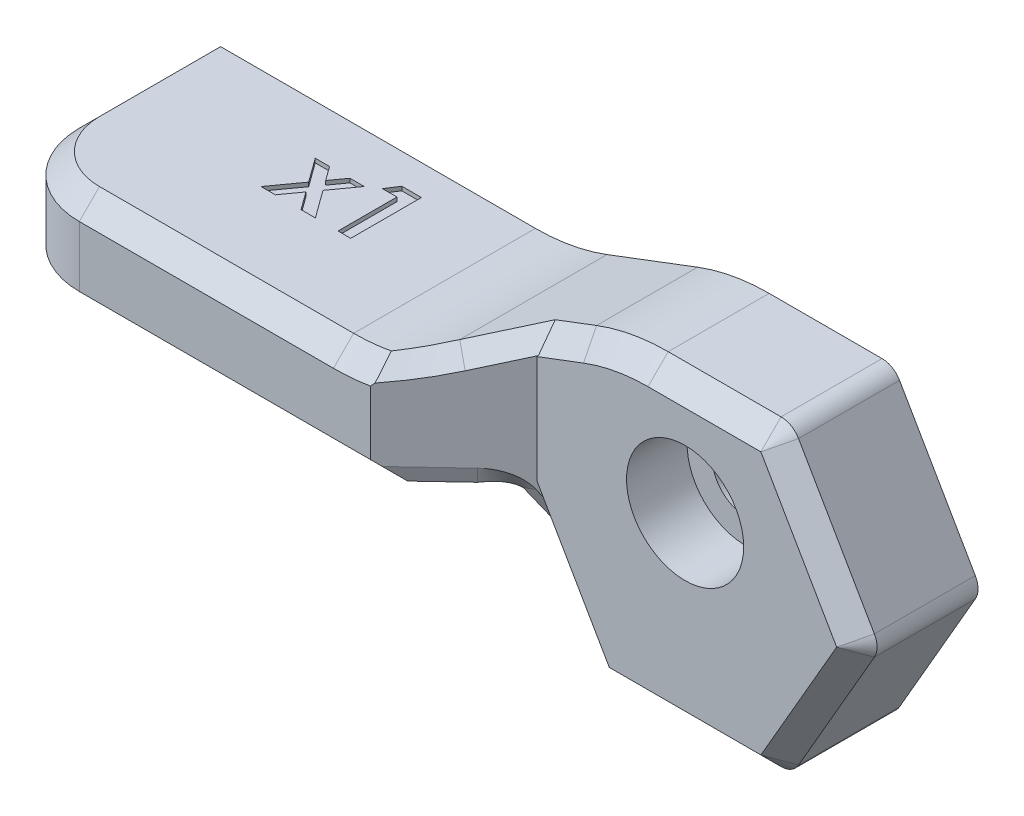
ISO-10303-21;
HEADER;
FILE_DESCRIPTION(('STEP AP214'),'2;1');
FILE_NAME('part.step','',(''),(''),'','','');
FILE_SCHEMA(('AUTOMOTIVE_DESIGN { 1 0 10303 214 1 1 1 1 }'));
ENDSEC;
DATA;
#1=APPLICATION_CONTEXT('core data for automotive mechanical design processes');
#2=APPLICATION_PROTOCOL_DEFINITION('international standard','automotive_design',2000,#1);
#3=PRODUCT_CONTEXT('',#1,'mechanical');
#4=PRODUCT('Part','Part','',(#3));
#5=PRODUCT_RELATED_PRODUCT_CATEGORY('part','',(#4));
#6=PRODUCT_DEFINITION_FORMATION('','',#4);
#7=PRODUCT_DEFINITION_CONTEXT('part definition',#1,'design');
#8=PRODUCT_DEFINITION('design','',#6,#7);
#9=PRODUCT_DEFINITION_SHAPE('','',#8);
#10=(LENGTH_UNIT() NAMED_UNIT(*) SI_UNIT(.MILLI.,.METRE.));
#11=(NAMED_UNIT(*) PLANE_ANGLE_UNIT() SI_UNIT($,.RADIAN.));
#12=(NAMED_UNIT(*) SI_UNIT($,.STERADIAN.) SOLID_ANGLE_UNIT());
#13=UNCERTAINTY_MEASURE_WITH_UNIT(LENGTH_MEASURE(1.E-05),#10,'distance_accuracy_value','');
#14=(GEOMETRIC_REPRESENTATION_CONTEXT(3) GLOBAL_UNCERTAINTY_ASSIGNED_CONTEXT((#13)) GLOBAL_UNIT_ASSIGNED_CONTEXT((#10,
#11,#12)) REPRESENTATION_CONTEXT('',''));
#15=CARTESIAN_POINT('',(0.,0.,0.));
#16=DIRECTION('',(0.,0.,1.));
#17=DIRECTION('',(1.,0.,0.));
#18=AXIS2_PLACEMENT_3D('',#15,#16,#17);
#19=CARTESIAN_POINT('',(-30.,4.5,10.));
#20=DIRECTION('',(0.,-1.,0.));
#21=DIRECTION('',(0.,0.,-1.));
#22=AXIS2_PLACEMENT_3D('',#19,#20,#21);
#23=PLANE('',#22);
#24=DIRECTION('',(-0.587147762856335,0.,-0.809479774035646));
#25=VECTOR('',#24,1.);
#26=CARTESIAN_POINT('',(-21.0107171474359,4.5,3.62930689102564));
#27=LINE('',#26,#25);
#28=CARTESIAN_POINT('',(-21.0107171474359,4.5,3.62930689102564));
#29=VERTEX_POINT('',#28);
#30=CARTESIAN_POINT('',(-21.8716947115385,4.5,2.44230769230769));
#31=VERTEX_POINT('',#30);
#32=EDGE_CURVE('E62',#29,#31,#27,.T.);
#33=ORIENTED_EDGE('',*,*,#32,.T.);
#34=DIRECTION('',(1.,0.,0.));
#35=VECTOR('',#34,1.);
#36=CARTESIAN_POINT('',(-21.8716947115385,4.5,2.44230769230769));
#37=LINE('',#36,#35);
#38=CARTESIAN_POINT('',(-21.1628605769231,4.5,2.44230769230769));
#39=VERTEX_POINT('',#38);
#40=EDGE_CURVE('E375',#31,#39,#37,.T.);
#41=ORIENTED_EDGE('',*,*,#40,.T.);
#42=DIRECTION('',(0.587154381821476,0.,0.809474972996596));
#43=VECTOR('',#42,1.);
#44=CARTESIAN_POINT('',(-21.1628605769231,4.5,2.44230769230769));
#45=LINE('',#44,#43);
#46=CARTESIAN_POINT('',(-20.6573517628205,4.5,3.13922275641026));
#47=VERTEX_POINT('',#46);
#48=EDGE_CURVE('E410',#39,#47,#45,.T.);
#49=ORIENTED_EDGE('',*,*,#48,.T.);
#50=DIRECTION('',(0.58555010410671,0.,-0.810636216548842));
#51=VECTOR('',#50,1.);
#52=CARTESIAN_POINT('',(-20.6573517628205,4.5,3.13922275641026));
#53=LINE('',#52,#51);
#54=CARTESIAN_POINT('',(-20.1539463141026,4.5,2.44230769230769));
#55=VERTEX_POINT('',#54);
#56=EDGE_CURVE('E413',#47,#55,#53,.T.);
#57=ORIENTED_EDGE('',*,*,#56,.T.);
#58=DIRECTION('',(1.,0.,0.));
#59=VECTOR('',#58,1.);
#60=CARTESIAN_POINT('',(-20.1539463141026,4.5,2.44230769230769));
#61=LINE('',#60,#59);
#62=CARTESIAN_POINT('',(-19.4451121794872,4.5,2.44230769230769));
#63=VERTEX_POINT('',#62);
#64=EDGE_CURVE('E416',#55,#63,#61,.T.);
#65=ORIENTED_EDGE('',*,*,#64,.T.);
#66=DIRECTION('',(-0.585263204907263,0.,0.81084337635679));
#67=VECTOR('',#66,1.);
#68=CARTESIAN_POINT('',(-19.4451121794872,4.5,2.44230769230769));
#69=LINE('',#68,#67);
#70=CARTESIAN_POINT('',(-20.3018830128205,4.5,3.62930689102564));
#71=VERTEX_POINT('',#70);
#72=EDGE_CURVE('E419',#63,#71,#69,.T.);
#73=ORIENTED_EDGE('',*,*,#72,.T.);
#74=DIRECTION('',(0.587137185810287,0.,0.809487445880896));
#75=VECTOR('',#74,1.);
#76=CARTESIAN_POINT('',(-20.3018830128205,4.5,3.62930689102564));
#77=LINE('',#76,#75);
#78=CARTESIAN_POINT('',(-19.3076923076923,4.5,5.));
#79=VERTEX_POINT('',#78);
#80=EDGE_CURVE('E422',#71,#79,#77,.T.);
#81=ORIENTED_EDGE('',*,*,#80,.T.);
#82=DIRECTION('',(-1.,0.,0.));
#83=VECTOR('',#82,1.);
#84=CARTESIAN_POINT('',(-19.3076923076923,4.5,5.));
#85=LINE('',#84,#83);
#86=CARTESIAN_POINT('',(-20.0165264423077,4.5,5.));
#87=VERTEX_POINT('',#86);
#88=EDGE_CURVE('E425',#79,#87,#85,.T.);
#89=ORIENTED_EDGE('',*,*,#88,.T.);
#90=DIRECTION('',(-0.587136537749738,0.,-0.809487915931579));
#91=VECTOR('',#90,1.);
#92=CARTESIAN_POINT('',(-20.0165264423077,4.5,5.));
#93=LINE('',#92,#91);
#94=CARTESIAN_POINT('',(-20.6552483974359,4.5,4.11939102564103));
#95=VERTEX_POINT('',#94);
#96=EDGE_CURVE('E428',#87,#95,#93,.T.);
#97=ORIENTED_EDGE('',*,*,#96,.T.);
#98=DIRECTION('',(-0.585443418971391,0.,0.81071326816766));
#99=VECTOR('',#98,1.);
#100=CARTESIAN_POINT('',(-20.6552483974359,4.5,4.11939102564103));
#101=LINE('',#100,#99);
#102=CARTESIAN_POINT('',(-21.2911658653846,4.5,5.));
#103=VERTEX_POINT('',#102);
#104=EDGE_CURVE('E431',#95,#103,#101,.T.);
#105=ORIENTED_EDGE('',*,*,#104,.T.);
#106=DIRECTION('',(-1.,0.,0.));
#107=VECTOR('',#106,1.);
#108=CARTESIAN_POINT('',(-21.2911658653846,4.5,5.));
#109=LINE('',#108,#107);
#110=CARTESIAN_POINT('',(-22.,4.5,5.));
#111=VERTEX_POINT('',#110);
#112=EDGE_CURVE('E434',#103,#111,#109,.T.);
#113=ORIENTED_EDGE('',*,*,#112,.T.);
#114=DIRECTION('',(0.585233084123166,0.,-0.810865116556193));
#115=VECTOR('',#114,1.);
#116=CARTESIAN_POINT('',(-22.,4.5,5.));
#117=LINE('',#116,#115);
#118=EDGE_CURVE('E385',#111,#29,#117,.T.);
#119=ORIENTED_EDGE('',*,*,#118,.T.);
#120=EDGE_LOOP('',(#33,#41,#49,#57,#65,#73,#81,#89,#97,#105,#113,#119));
#121=FACE_BOUND('',#120,.T.);
#122=DIRECTION('',(-1.,0.,0.));
#123=VECTOR('',#122,1.);
#124=CARTESIAN_POINT('',(-30.,4.5,0.));
#125=LINE('',#124,#123);
#126=CARTESIAN_POINT('',(-13.4126089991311,4.5,0.));
#127=VERTEX_POINT('',#126);
#128=CARTESIAN_POINT('',(-29.,4.5,0.));
#129=VERTEX_POINT('',#128);
#130=EDGE_CURVE('E483',#127,#129,#125,.T.);
#131=ORIENTED_EDGE('',*,*,#130,.T.);
#132=DIRECTION('',(0.,0.,1.));
#133=VECTOR('',#132,1.);
#134=CARTESIAN_POINT('',(-29.,4.5,10.));
#135=LINE('',#134,#133);
#136=CARTESIAN_POINT('',(-29.,4.5,6.));
#137=VERTEX_POINT('',#136);
#138=EDGE_CURVE('E907',#129,#137,#135,.T.);
#139=ORIENTED_EDGE('',*,*,#138,.T.);
#140=CARTESIAN_POINT('',(-26.,4.5,6.));
#141=DIRECTION('',(0.,-1.,0.));
#142=DIRECTION('',(0.,0.,-1.));
#143=AXIS2_PLACEMENT_3D('',#140,#141,#142);
#144=CIRCLE('',#143,2.99999999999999);
#145=CARTESIAN_POINT('',(-26.,4.5,9.));
#146=VERTEX_POINT('',#145);
#147=EDGE_CURVE('E905',#137,#146,#144,.F.);
#148=ORIENTED_EDGE('',*,*,#147,.T.);
#149=DIRECTION('',(1.,0.,0.));
#150=VECTOR('',#149,1.);
#151=CARTESIAN_POINT('',(-13.4126089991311,4.5,9.));
#152=LINE('',#151,#150);
#153=CARTESIAN_POINT('',(-13.4126089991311,4.5,9.));
#154=VERTEX_POINT('',#153);
#155=EDGE_CURVE('E898',#146,#154,#152,.T.);
#156=ORIENTED_EDGE('',*,*,#155,.T.);
#157=DIRECTION('',(0.,0.,-1.));
#158=VECTOR('',#157,1.);
#159=CARTESIAN_POINT('',(-13.4126089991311,4.5,0.));
#160=LINE('',#159,#158);
#161=EDGE_CURVE('E957',#154,#127,#160,.T.);
#162=ORIENTED_EDGE('',*,*,#161,.T.);
#163=EDGE_LOOP('',(#131,#139,#148,#156,#162));
#164=FACE_BOUND('',#163,.T.);
#165=DIRECTION('',(0.540859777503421,0.,-0.841112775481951));
#166=VECTOR('',#165,1.);
#167=CARTESIAN_POINT('',(-18.9038461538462,4.5,2.08333333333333));
#168=LINE('',#167,#166);
#169=CARTESIAN_POINT('',(-18.9038461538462,4.5,2.08333333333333));
#170=VERTEX_POINT('',#169);
#171=CARTESIAN_POINT('',(-18.5287459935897,4.5,1.5));
#172=VERTEX_POINT('',#171);
#173=EDGE_CURVE('E54',#170,#172,#168,.T.);
#174=ORIENTED_EDGE('',*,*,#173,.T.);
#175=DIRECTION('',(1.,0.,0.));
#176=VECTOR('',#175,1.);
#177=CARTESIAN_POINT('',(-18.5287459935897,4.5,1.5));
#178=LINE('',#177,#176);
#179=CARTESIAN_POINT('',(-17.5576923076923,4.5,1.5));
#180=VERTEX_POINT('',#179);
#181=EDGE_CURVE('E372',#172,#180,#178,.T.);
#182=ORIENTED_EDGE('',*,*,#181,.T.);
#183=DIRECTION('',(0.,0.,1.));
#184=VECTOR('',#183,1.);
#185=CARTESIAN_POINT('',(-17.5576923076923,4.5,1.5));
#186=LINE('',#185,#184);
#187=CARTESIAN_POINT('',(-17.5576923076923,4.5,5.));
#188=VERTEX_POINT('',#187);
#189=EDGE_CURVE('E1667',#180,#188,#186,.T.);
#190=ORIENTED_EDGE('',*,*,#189,.T.);
#191=DIRECTION('',(-1.,0.,0.));
#192=VECTOR('',#191,1.);
#193=CARTESIAN_POINT('',(-17.5576923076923,4.5,5.));
#194=LINE('',#193,#192);
#195=CARTESIAN_POINT('',(-18.1858974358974,4.5,5.));
#196=VERTEX_POINT('',#195);
#197=EDGE_CURVE('E1664',#188,#196,#194,.T.);
#198=ORIENTED_EDGE('',*,*,#197,.T.);
#199=DIRECTION('',(0.,0.,-1.));
#200=VECTOR('',#199,1.);
#201=CARTESIAN_POINT('',(-18.1858974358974,4.5,5.));
#202=LINE('',#201,#200);
#203=CARTESIAN_POINT('',(-18.1858974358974,4.5,2.08333333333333));
#204=VERTEX_POINT('',#203);
#205=EDGE_CURVE('E1658',#196,#204,#202,.T.);
#206=ORIENTED_EDGE('',*,*,#205,.T.);
#207=DIRECTION('',(-1.,0.,0.));
#208=VECTOR('',#207,1.);
#209=CARTESIAN_POINT('',(-18.1858974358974,4.5,2.08333333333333));
#210=LINE('',#209,#208);
#211=EDGE_CURVE('E368',#204,#170,#210,.T.);
#212=ORIENTED_EDGE('',*,*,#211,.T.);
#213=EDGE_LOOP('',(#174,#182,#190,#198,#206,#212));
#214=FACE_BOUND('',#213,.T.);
#215=ADVANCED_FACE('F35',(#121,#164,#214),#23,.F.);
#216=CARTESIAN_POINT('',(0.,2.,0.));
#217=DIRECTION('',(0.,0.,1.));
#218=DIRECTION('',(1.,0.,0.));
#219=AXIS2_PLACEMENT_3D('',#216,#217,#218);
#220=CYLINDRICAL_SURFACE('',#219,1.65);
#221=CARTESIAN_POINT('',(0.,2.,0.));
#222=DIRECTION('',(0.,0.,1.));
#223=DIRECTION('',(1.,0.,0.));
#224=AXIS2_PLACEMENT_3D('',#221,#222,#223);
#225=CIRCLE('',#224,1.65);
#226=CARTESIAN_POINT('',(1.65,2.,0.));
#227=VERTEX_POINT('',#226);
#228=EDGE_CURVE('E471',#227,#227,#225,.T.);
#229=ORIENTED_EDGE('',*,*,#228,.F.);
#230=EDGE_LOOP('',(#229));
#231=FACE_BOUND('',#230,.T.);
#232=CARTESIAN_POINT('',(0.,2.,3.));
#233=DIRECTION('',(0.,0.,1.));
#234=DIRECTION('',(1.,0.,0.));
#235=AXIS2_PLACEMENT_3D('',#232,#233,#234);
#236=CIRCLE('',#235,1.65);
#237=CARTESIAN_POINT('',(1.65,2.,3.));
#238=VERTEX_POINT('',#237);
#239=EDGE_CURVE('E466',#238,#238,#236,.F.);
#240=ORIENTED_EDGE('',*,*,#239,.F.);
#241=EDGE_LOOP('',(#240));
#242=FACE_BOUND('',#241,.T.);
#243=ADVANCED_FACE('F605',(#231,#242),#220,.F.);
#244=CARTESIAN_POINT('',(-11.5799906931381,4.5,10.));
#245=DIRECTION('',(0.35461398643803,-0.935012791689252,0.));
#246=DIRECTION('',(0.935012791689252,0.35461398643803,0.));
#247=AXIS2_PLACEMENT_3D('',#244,#245,#246);
#248=PLANE('',#247);
#249=DIRECTION('',(0.,0.,-1.));
#250=VECTOR('',#249,1.);
#251=CARTESIAN_POINT('',(-9.86646913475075,5.14987208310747,10.));
#252=LINE('',#251,#250);
#253=CARTESIAN_POINT('',(-9.86646913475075,5.14987208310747,0.));
#254=VERTEX_POINT('',#253);
#255=CARTESIAN_POINT('',(-9.86646913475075,5.14987208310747,7.29076062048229));
#256=VERTEX_POINT('',#255);
#257=EDGE_CURVE('E917',#254,#256,#252,.F.);
#258=ORIENTED_EDGE('',*,*,#257,.T.);
#259=DIRECTION('',(0.702167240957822,0.266304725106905,-0.660335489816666));
#260=VECTOR('',#259,1.);
#261=CARTESIAN_POINT('',(-12.0890037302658,4.30695115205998,9.38088728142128));
#262=LINE('',#261,#260);
#263=CARTESIAN_POINT('',(-7.43059057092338,6.07370608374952,5.00000000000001));
#264=VERTEX_POINT('',#263);
#265=EDGE_CURVE('E650',#256,#264,#262,.T.);
#266=ORIENTED_EDGE('',*,*,#265,.T.);
#267=DIRECTION('',(0.935012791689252,0.35461398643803,0.));
#268=VECTOR('',#267,1.);
#269=CARTESIAN_POINT('',(-11.5799906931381,4.5,5.00000000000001));
#270=LINE('',#269,#268);
#271=CARTESIAN_POINT('',(-5.38339453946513,6.85012791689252,5.00000000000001));
#272=VERTEX_POINT('',#271);
#273=EDGE_CURVE('E649',#264,#272,#270,.T.);
#274=ORIENTED_EDGE('',*,*,#273,.T.);
#275=DIRECTION('',(0.,0.,-1.));
#276=VECTOR('',#275,1.);
#277=CARTESIAN_POINT('',(-5.38339453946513,6.85012791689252,10.));
#278=LINE('',#277,#276);
#279=CARTESIAN_POINT('',(-5.38339453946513,6.85012791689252,0.));
#280=VERTEX_POINT('',#279);
#281=EDGE_CURVE('E921',#272,#280,#278,.T.);
#282=ORIENTED_EDGE('',*,*,#281,.T.);
#283=DIRECTION('',(-0.935012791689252,-0.35461398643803,0.));
#284=VECTOR('',#283,1.);
#285=CARTESIAN_POINT('',(-11.5799906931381,4.5,0.));
#286=LINE('',#285,#284);
#287=EDGE_CURVE('E478',#280,#254,#286,.T.);
#288=ORIENTED_EDGE('',*,*,#287,.T.);
#289=EDGE_LOOP('',(#258,#266,#274,#282,#288));
#290=FACE_BOUND('',#289,.T.);
#291=ADVANCED_FACE('F542',(#290),#248,.F.);
#292=CARTESIAN_POINT('',(-30.,4.5,10.));
#293=DIRECTION('',(1.,0.,0.));
#294=DIRECTION('',(0.,0.,-1.));
#295=AXIS2_PLACEMENT_3D('',#292,#293,#294);
#296=PLANE('',#295);
#297=DIRECTION('',(0.,-1.,0.));
#298=VECTOR('',#297,1.);
#299=CARTESIAN_POINT('',(-30.,4.5,6.));
#300=LINE('',#299,#298);
#301=CARTESIAN_POINT('',(-30.,0.500000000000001,6.));
#302=VERTEX_POINT('',#301);
#303=CARTESIAN_POINT('',(-30.,3.49999999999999,6.));
#304=VERTEX_POINT('',#303);
#305=EDGE_CURVE('E935',#302,#304,#300,.F.);
#306=ORIENTED_EDGE('',*,*,#305,.T.);
#307=DIRECTION('',(0.,0.,-1.));
#308=VECTOR('',#307,1.);
#309=CARTESIAN_POINT('',(-30.,3.49999999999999,10.));
#310=LINE('',#309,#308);
#311=CARTESIAN_POINT('',(-30.,3.49999999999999,0.));
#312=VERTEX_POINT('',#311);
#313=EDGE_CURVE('E896',#304,#312,#310,.T.);
#314=ORIENTED_EDGE('',*,*,#313,.T.);
#315=DIRECTION('',(0.,-1.,0.));
#316=VECTOR('',#315,1.);
#317=CARTESIAN_POINT('',(-30.,4.5,0.));
#318=LINE('',#317,#316);
#319=CARTESIAN_POINT('',(-30.,0.500000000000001,0.));
#320=VERTEX_POINT('',#319);
#321=EDGE_CURVE('E486',#312,#320,#318,.T.);
#322=ORIENTED_EDGE('',*,*,#321,.T.);
#323=DIRECTION('',(0.,0.,1.));
#324=VECTOR('',#323,1.);
#325=CARTESIAN_POINT('',(-30.,0.500000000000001,10.));
#326=LINE('',#325,#324);
#327=EDGE_CURVE('E891',#320,#302,#326,.T.);
#328=ORIENTED_EDGE('',*,*,#327,.T.);
#329=EDGE_LOOP('',(#306,#314,#322,#328));
#330=FACE_BOUND('',#329,.T.);
#331=ADVANCED_FACE('F939',(#330),#296,.F.);
#332=CARTESIAN_POINT('',(-30.,-0.500000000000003,10.));
#333=DIRECTION('',(0.,1.,0.));
#334=DIRECTION('',(0.,0.,1.));
#335=AXIS2_PLACEMENT_3D('',#332,#333,#334);
#336=PLANE('',#335);
#337=CARTESIAN_POINT('',(-26.,-0.500000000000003,6.));
#338=DIRECTION('',(0.,1.,0.));
#339=DIRECTION('',(0.,0.,1.));
#340=AXIS2_PLACEMENT_3D('',#337,#338,#339);
#341=CIRCLE('',#340,2.99999999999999);
#342=CARTESIAN_POINT('',(-26.,-0.500000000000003,8.99999999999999));
#343=VERTEX_POINT('',#342);
#344=CARTESIAN_POINT('',(-29.,-0.500000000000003,6.));
#345=VERTEX_POINT('',#344);
#346=EDGE_CURVE('E639',#343,#345,#341,.F.);
#347=ORIENTED_EDGE('',*,*,#346,.T.);
#348=DIRECTION('',(0.,0.,-1.));
#349=VECTOR('',#348,1.);
#350=CARTESIAN_POINT('',(-29.,-0.500000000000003,10.));
#351=LINE('',#350,#349);
#352=CARTESIAN_POINT('',(-29.,-0.500000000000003,0.));
#353=VERTEX_POINT('',#352);
#354=EDGE_CURVE('E515',#345,#353,#351,.T.);
#355=ORIENTED_EDGE('',*,*,#354,.T.);
#356=DIRECTION('',(1.,0.,0.));
#357=VECTOR('',#356,1.);
#358=CARTESIAN_POINT('',(-30.,-0.500000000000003,0.));
#359=LINE('',#358,#357);
#360=CARTESIAN_POINT('',(-8.9489291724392,-0.500000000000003,0.));
#361=VERTEX_POINT('',#360);
#362=EDGE_CURVE('E489',#353,#361,#359,.T.);
#363=ORIENTED_EDGE('',*,*,#362,.T.);
#364=DIRECTION('',(0.,0.,-1.));
#365=VECTOR('',#364,1.);
#366=CARTESIAN_POINT('',(-8.9489291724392,-0.500000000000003,10.));
#367=LINE('',#366,#365);
#368=CARTESIAN_POINT('',(-8.9489291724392,-0.500000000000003,7.31785616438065));
#369=VERTEX_POINT('',#368);
#370=EDGE_CURVE('E514',#361,#369,#367,.F.);
#371=ORIENTED_EDGE('',*,*,#370,.T.);
#372=DIRECTION('',(-0.72847321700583,0.,0.685074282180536));
#373=VECTOR('',#372,1.);
#374=CARTESIAN_POINT('',(-21.4587149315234,-0.500000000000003,19.0823689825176));
#375=LINE('',#374,#373);
#376=CARTESIAN_POINT('',(-10.7376355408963,-0.500000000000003,8.99999999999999));
#377=VERTEX_POINT('',#376);
#378=EDGE_CURVE('E632',#369,#377,#375,.T.);
#379=ORIENTED_EDGE('',*,*,#378,.T.);
#380=DIRECTION('',(-1.,0.,0.));
#381=VECTOR('',#380,1.);
#382=CARTESIAN_POINT('',(-26.,-0.500000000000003,8.99999999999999));
#383=LINE('',#382,#381);
#384=EDGE_CURVE('E636',#377,#343,#383,.T.);
#385=ORIENTED_EDGE('',*,*,#384,.T.);
#386=EDGE_LOOP('',(#347,#355,#363,#371,#379,#385));
#387=FACE_BOUND('',#386,.T.);
#388=ADVANCED_FACE('F882',(#387),#336,.F.);
#389=CARTESIAN_POINT('',(-8.37157890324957,-0.500000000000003,10.));
#390=DIRECTION('',(0.866025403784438,0.5,0.));
#391=DIRECTION('',(-0.5,0.866025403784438,0.));
#392=AXIS2_PLACEMENT_3D('',#389,#390,#391);
#393=PLANE('',#392);
#394=DIRECTION('',(-0.5,0.866025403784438,0.));
#395=VECTOR('',#394,1.);
#396=CARTESIAN_POINT('',(-8.37157890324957,-0.500000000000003,5.00000000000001));
#397=LINE('',#396,#395);
#398=CARTESIAN_POINT('',(-4.618802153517,-7.,5.00000000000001));
#399=VERTEX_POINT('',#398);
#400=CARTESIAN_POINT('',(-7.10358940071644,-2.69622224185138,5.00000000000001));
#401=VERTEX_POINT('',#400);
#402=EDGE_CURVE('E528',#399,#401,#397,.T.);
#403=ORIENTED_EDGE('',*,*,#402,.T.);
#404=DIRECTION('',(-0.452474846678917,0.783709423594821,0.42551856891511));
#405=VECTOR('',#404,1.);
#406=CARTESIAN_POINT('',(-9.10467129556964,0.769753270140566,6.8818670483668));
#407=LINE('',#406,#405);
#408=CARTESIAN_POINT('',(-8.08290376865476,-1.,5.92097152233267));
#409=VERTEX_POINT('',#408);
#410=EDGE_CURVE('E644',#401,#409,#407,.T.);
#411=ORIENTED_EDGE('',*,*,#410,.T.);
#412=DIRECTION('',(0.,0.,-1.));
#413=VECTOR('',#412,1.);
#414=CARTESIAN_POINT('',(-8.08290376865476,-1.,0.));
#415=LINE('',#414,#413);
#416=CARTESIAN_POINT('',(-8.08290376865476,-1.,0.));
#417=VERTEX_POINT('',#416);
#418=EDGE_CURVE('E506',#409,#417,#415,.T.);
#419=ORIENTED_EDGE('',*,*,#418,.T.);
#420=DIRECTION('',(0.5,-0.866025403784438,0.));
#421=VECTOR('',#420,1.);
#422=CARTESIAN_POINT('',(-8.37157890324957,-0.500000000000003,0.));
#423=LINE('',#422,#421);
#424=CARTESIAN_POINT('',(-4.618802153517,-7.,0.));
#425=VERTEX_POINT('',#424);
#426=EDGE_CURVE('E491',#417,#425,#423,.T.);
#427=ORIENTED_EDGE('',*,*,#426,.T.);
#428=DIRECTION('',(0.,0.,-1.));
#429=VECTOR('',#428,1.);
#430=CARTESIAN_POINT('',(-4.618802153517,-7.,10.));
#431=LINE('',#430,#429);
#432=EDGE_CURVE('E997',#425,#399,#431,.F.);
#433=ORIENTED_EDGE('',*,*,#432,.T.);
#434=EDGE_LOOP('',(#403,#411,#419,#427,#433));
#435=FACE_BOUND('',#434,.T.);
#436=ADVANCED_FACE('F1041',(#435),#393,.F.);
#437=CARTESIAN_POINT('',(-4.33012701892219,-7.5,10.));
#438=DIRECTION('',(0.,1.,0.));
#439=DIRECTION('',(-1.,0.,0.));
#440=AXIS2_PLACEMENT_3D('',#437,#438,#439);
#441=PLANE('',#440);
#442=DIRECTION('',(0.,0.,-1.));
#443=VECTOR('',#442,1.);
#444=CARTESIAN_POINT('',(3.75277674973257,-7.5,10.));
#445=LINE('',#444,#443);
#446=CARTESIAN_POINT('',(3.75277674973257,-7.5,0.));
#447=VERTEX_POINT('',#446);
#448=CARTESIAN_POINT('',(3.75277674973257,-7.5,5.00000000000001));
#449=VERTEX_POINT('',#448);
#450=EDGE_CURVE('E990',#447,#449,#445,.F.);
#451=ORIENTED_EDGE('',*,*,#450,.T.);
#452=DIRECTION('',(-1.,0.,0.));
#453=VECTOR('',#452,1.);
#454=CARTESIAN_POINT('',(-4.33012701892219,-7.5,5.00000000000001));
#455=LINE('',#454,#453);
#456=CARTESIAN_POINT('',(-3.75277674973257,-7.5,5.00000000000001));
#457=VERTEX_POINT('',#456);
#458=EDGE_CURVE('E674',#449,#457,#455,.T.);
#459=ORIENTED_EDGE('',*,*,#458,.T.);
#460=DIRECTION('',(0.,0.,-1.));
#461=VECTOR('',#460,1.);
#462=CARTESIAN_POINT('',(-3.75277674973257,-7.5,10.));
#463=LINE('',#462,#461);
#464=CARTESIAN_POINT('',(-3.75277674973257,-7.5,0.));
#465=VERTEX_POINT('',#464);
#466=EDGE_CURVE('E986',#457,#465,#463,.T.);
#467=ORIENTED_EDGE('',*,*,#466,.T.);
#468=DIRECTION('',(1.,0.,0.));
#469=VECTOR('',#468,1.);
#470=CARTESIAN_POINT('',(-4.33012701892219,-7.5,0.));
#471=LINE('',#470,#469);
#472=EDGE_CURVE('E494',#465,#447,#471,.T.);
#473=ORIENTED_EDGE('',*,*,#472,.T.);
#474=EDGE_LOOP('',(#451,#459,#467,#473));
#475=FACE_BOUND('',#474,.T.);
#476=ADVANCED_FACE('F1037',(#475),#441,.F.);
#477=CARTESIAN_POINT('',(4.33012701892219,-7.5,10.));
#478=DIRECTION('',(-0.866025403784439,0.5,0.));
#479=DIRECTION('',(-0.5,-0.866025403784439,0.));
#480=AXIS2_PLACEMENT_3D('',#477,#478,#479);
#481=PLANE('',#480);
#482=DIRECTION('',(0.,0.,-1.));
#483=VECTOR('',#482,1.);
#484=CARTESIAN_POINT('',(8.37157890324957,-0.499999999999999,10.));
#485=LINE('',#484,#483);
#486=CARTESIAN_POINT('',(8.37157890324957,-0.499999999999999,0.));
#487=VERTEX_POINT('',#486);
#488=CARTESIAN_POINT('',(8.37157890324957,-0.499999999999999,5.00000000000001));
#489=VERTEX_POINT('',#488);
#490=EDGE_CURVE('E999',#487,#489,#485,.F.);
#491=ORIENTED_EDGE('',*,*,#490,.T.);
#492=DIRECTION('',(-0.5,-0.866025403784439,0.));
#493=VECTOR('',#492,1.);
#494=CARTESIAN_POINT('',(4.33012701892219,-7.5,5.00000000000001));
#495=LINE('',#494,#493);
#496=CARTESIAN_POINT('',(4.61880215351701,-7.,5.00000000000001));
#497=VERTEX_POINT('',#496);
#498=EDGE_CURVE('E678',#489,#497,#495,.T.);
#499=ORIENTED_EDGE('',*,*,#498,.T.);
#500=DIRECTION('',(0.,0.,-1.));
#501=VECTOR('',#500,1.);
#502=CARTESIAN_POINT('',(4.61880215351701,-7.,10.));
#503=LINE('',#502,#501);
#504=CARTESIAN_POINT('',(4.61880215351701,-7.,0.));
#505=VERTEX_POINT('',#504);
#506=EDGE_CURVE('E1002',#497,#505,#503,.T.);
#507=ORIENTED_EDGE('',*,*,#506,.T.);
#508=DIRECTION('',(0.5,0.866025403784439,0.));
#509=VECTOR('',#508,1.);
#510=CARTESIAN_POINT('',(4.33012701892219,-7.5,0.));
#511=LINE('',#510,#509);
#512=EDGE_CURVE('E497',#505,#487,#511,.T.);
#513=ORIENTED_EDGE('',*,*,#512,.T.);
#514=EDGE_LOOP('',(#491,#499,#507,#513));
#515=FACE_BOUND('',#514,.T.);
#516=ADVANCED_FACE('F1033',(#515),#481,.F.);
#517=CARTESIAN_POINT('',(8.66025403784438,0.,10.));
#518=DIRECTION('',(-0.866025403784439,-0.5,0.));
#519=DIRECTION('',(0.5,-0.866025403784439,0.));
#520=AXIS2_PLACEMENT_3D('',#517,#518,#519);
#521=PLANE('',#520);
#522=DIRECTION('',(0.,0.,-1.));
#523=VECTOR('',#522,1.);
#524=CARTESIAN_POINT('',(4.618802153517,7.,10.));
#525=LINE('',#524,#523);
#526=CARTESIAN_POINT('',(4.618802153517,7.,0.));
#527=VERTEX_POINT('',#526);
#528=CARTESIAN_POINT('',(4.618802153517,7.,5.00000000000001));
#529=VERTEX_POINT('',#528);
#530=EDGE_CURVE('E983',#527,#529,#525,.F.);
#531=ORIENTED_EDGE('',*,*,#530,.T.);
#532=DIRECTION('',(0.5,-0.866025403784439,0.));
#533=VECTOR('',#532,1.);
#534=CARTESIAN_POINT('',(8.66025403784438,0.,5.00000000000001));
#535=LINE('',#534,#533);
#536=CARTESIAN_POINT('',(8.37157890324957,0.500000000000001,5.00000000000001));
#537=VERTEX_POINT('',#536);
#538=EDGE_CURVE('E682',#529,#537,#535,.T.);
#539=ORIENTED_EDGE('',*,*,#538,.T.);
#540=DIRECTION('',(0.,0.,-1.));
#541=VECTOR('',#540,1.);
#542=CARTESIAN_POINT('',(8.37157890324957,0.500000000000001,10.));
#543=LINE('',#542,#541);
#544=CARTESIAN_POINT('',(8.37157890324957,0.500000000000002,0.));
#545=VERTEX_POINT('',#544);
#546=EDGE_CURVE('E978',#537,#545,#543,.T.);
#547=ORIENTED_EDGE('',*,*,#546,.T.);
#548=DIRECTION('',(-0.5,0.866025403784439,0.));
#549=VECTOR('',#548,1.);
#550=CARTESIAN_POINT('',(8.66025403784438,0.,0.));
#551=LINE('',#550,#549);
#552=EDGE_CURVE('E500',#545,#527,#551,.T.);
#553=ORIENTED_EDGE('',*,*,#552,.T.);
#554=EDGE_LOOP('',(#531,#539,#547,#553));
#555=FACE_BOUND('',#554,.T.);
#556=ADVANCED_FACE('F1030',(#555),#521,.F.);
#557=CARTESIAN_POINT('',(4.33012701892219,7.5,10.));
#558=DIRECTION('',(0.,-1.,0.));
#559=DIRECTION('',(1.,0.,0.));
#560=AXIS2_PLACEMENT_3D('',#557,#558,#559);
#561=PLANE('',#560);
#562=DIRECTION('',(0.,0.,-1.));
#563=VECTOR('',#562,1.);
#564=CARTESIAN_POINT('',(-1.83725467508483,7.5,10.));
#565=LINE('',#564,#563);
#566=CARTESIAN_POINT('',(-1.83725467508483,7.5,0.));
#567=VERTEX_POINT('',#566);
#568=CARTESIAN_POINT('',(-1.83725467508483,7.5,5.00000000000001));
#569=VERTEX_POINT('',#568);
#570=EDGE_CURVE('E927',#567,#569,#565,.F.);
#571=ORIENTED_EDGE('',*,*,#570,.T.);
#572=DIRECTION('',(1.,0.,0.));
#573=VECTOR('',#572,1.);
#574=CARTESIAN_POINT('',(4.33012701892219,7.5,5.00000000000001));
#575=LINE('',#574,#573);
#576=CARTESIAN_POINT('',(3.75277674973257,7.5,5.00000000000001));
#577=VERTEX_POINT('',#576);
#578=EDGE_CURVE('E686',#569,#577,#575,.T.);
#579=ORIENTED_EDGE('',*,*,#578,.T.);
#580=DIRECTION('',(0.,0.,-1.));
#581=VECTOR('',#580,1.);
#582=CARTESIAN_POINT('',(3.75277674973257,7.5,10.));
#583=LINE('',#582,#581);
#584=CARTESIAN_POINT('',(3.75277674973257,7.5,0.));
#585=VERTEX_POINT('',#584);
#586=EDGE_CURVE('E960',#577,#585,#583,.T.);
#587=ORIENTED_EDGE('',*,*,#586,.T.);
#588=DIRECTION('',(-1.,0.,0.));
#589=VECTOR('',#588,1.);
#590=CARTESIAN_POINT('',(4.33012701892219,7.5,0.));
#591=LINE('',#590,#589);
#592=EDGE_CURVE('E503',#585,#567,#591,.T.);
#593=ORIENTED_EDGE('',*,*,#592,.T.);
#594=EDGE_LOOP('',(#571,#579,#587,#593));
#595=FACE_BOUND('',#594,.T.);
#596=ADVANCED_FACE('F973',(#595),#561,.F.);
#597=CARTESIAN_POINT('',(0.,0.,10.));
#598=DIRECTION('',(0.,0.,1.));
#599=DIRECTION('',(1.,0.,0.));
#600=AXIS2_PLACEMENT_3D('',#597,#598,#599);
#601=PLANE('',#600);
#602=CARTESIAN_POINT('',(-13.4126089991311,14.5,10.));
#603=DIRECTION('',(0.,0.,1.));
#604=DIRECTION('',(1.,0.,0.));
#605=AXIS2_PLACEMENT_3D('',#602,#603,#604);
#606=CIRCLE('',#605,11.);
#607=CARTESIAN_POINT('',(-11.5799906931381,3.65373289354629,10.));
#608=VERTEX_POINT('',#607);
#609=CARTESIAN_POINT('',(-13.4126089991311,3.49999999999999,10.));
#610=VERTEX_POINT('',#609);
#611=EDGE_CURVE('E914',#608,#610,#606,.F.);
#612=ORIENTED_EDGE('',*,*,#611,.T.);
#613=DIRECTION('',(-1.,0.,0.));
#614=VECTOR('',#613,1.);
#615=CARTESIAN_POINT('',(-26.,3.49999999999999,10.));
#616=LINE('',#615,#614);
#617=CARTESIAN_POINT('',(-26.,3.49999999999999,10.));
#618=VERTEX_POINT('',#617);
#619=EDGE_CURVE('E916',#610,#618,#616,.T.);
#620=ORIENTED_EDGE('',*,*,#619,.T.);
#621=DIRECTION('',(0.,-1.,0.));
#622=VECTOR('',#621,1.);
#623=CARTESIAN_POINT('',(-26.,-0.500000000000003,10.));
#624=LINE('',#623,#622);
#625=CARTESIAN_POINT('',(-26.,0.500000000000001,10.));
#626=VERTEX_POINT('',#625);
#627=EDGE_CURVE('E932',#618,#626,#624,.T.);
#628=ORIENTED_EDGE('',*,*,#627,.T.);
#629=DIRECTION('',(1.,0.,0.));
#630=VECTOR('',#629,1.);
#631=CARTESIAN_POINT('',(-11.5799906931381,0.500000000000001,10.));
#632=LINE('',#631,#630);
#633=CARTESIAN_POINT('',(-11.5799906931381,0.499999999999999,10.));
#634=VERTEX_POINT('',#633);
#635=EDGE_CURVE('E912',#626,#634,#632,.T.);
#636=ORIENTED_EDGE('',*,*,#635,.T.);
#637=DIRECTION('',(0.,1.,0.));
#638=VECTOR('',#637,1.);
#639=CARTESIAN_POINT('',(-11.5799906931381,-7.5,10.));
#640=LINE('',#639,#638);
#641=EDGE_CURVE('E475',#634,#608,#640,.T.);
#642=ORIENTED_EDGE('',*,*,#641,.T.);
#643=EDGE_LOOP('',(#612,#620,#628,#636,#642));
#644=FACE_BOUND('',#643,.T.);
#645=ADVANCED_FACE('F1021',(#644),#601,.T.);
#646=CARTESIAN_POINT('',(0.,0.,0.));
#647=DIRECTION('',(0.,0.,1.));
#648=DIRECTION('',(1.,0.,0.));
#649=AXIS2_PLACEMENT_3D('',#646,#647,#648);
#650=PLANE('',#649);
#651=ORIENTED_EDGE('',*,*,#228,.T.);
#652=EDGE_LOOP('',(#651));
#653=FACE_BOUND('',#652,.T.);
#654=ORIENTED_EDGE('',*,*,#321,.F.);
#655=DIRECTION('',(-0.707106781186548,-0.707106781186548,0.));
#656=VECTOR('',#655,1.);
#657=CARTESIAN_POINT('',(-30.,3.49999999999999,0.));
#658=LINE('',#657,#656);
#659=EDGE_CURVE('E895',#312,#129,#658,.F.);
#660=ORIENTED_EDGE('',*,*,#659,.T.);
#661=ORIENTED_EDGE('',*,*,#130,.F.);
#662=CARTESIAN_POINT('',(-13.4126089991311,14.5,0.));
#663=DIRECTION('',(0.,0.,1.));
#664=DIRECTION('',(1.,0.,0.));
#665=AXIS2_PLACEMENT_3D('',#662,#663,#664);
#666=CIRCLE('',#665,10.);
#667=EDGE_CURVE('E930',#127,#254,#666,.T.);
#668=ORIENTED_EDGE('',*,*,#667,.T.);
#669=ORIENTED_EDGE('',*,*,#287,.F.);
#670=CARTESIAN_POINT('',(-1.83725467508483,-2.5,0.));
#671=DIRECTION('',(0.,0.,1.));
#672=DIRECTION('',(1.,0.,0.));
#673=AXIS2_PLACEMENT_3D('',#670,#671,#672);
#674=CIRCLE('',#673,10.);
#675=EDGE_CURVE('E920',#280,#567,#674,.F.);
#676=ORIENTED_EDGE('',*,*,#675,.T.);
#677=ORIENTED_EDGE('',*,*,#592,.F.);
#678=CARTESIAN_POINT('',(3.75277674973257,6.5,0.));
#679=DIRECTION('',(0.,0.,1.));
#680=DIRECTION('',(1.,0.,0.));
#681=AXIS2_PLACEMENT_3D('',#678,#679,#680);
#682=CIRCLE('',#681,1.);
#683=EDGE_CURVE('E981',#585,#527,#682,.F.);
#684=ORIENTED_EDGE('',*,*,#683,.T.);
#685=ORIENTED_EDGE('',*,*,#552,.F.);
#686=CARTESIAN_POINT('',(7.50555349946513,0.,0.));
#687=DIRECTION('',(0.,0.,1.));
#688=DIRECTION('',(1.,0.,0.));
#689=AXIS2_PLACEMENT_3D('',#686,#687,#688);
#690=CIRCLE('',#689,1.);
#691=EDGE_CURVE('E985',#545,#487,#690,.F.);
#692=ORIENTED_EDGE('',*,*,#691,.T.);
#693=ORIENTED_EDGE('',*,*,#512,.F.);
#694=CARTESIAN_POINT('',(3.75277674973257,-6.5,0.));
#695=DIRECTION('',(0.,0.,1.));
#696=DIRECTION('',(1.,0.,0.));
#697=AXIS2_PLACEMENT_3D('',#694,#695,#696);
#698=CIRCLE('',#697,1.);
#699=EDGE_CURVE('E988',#505,#447,#698,.F.);
#700=ORIENTED_EDGE('',*,*,#699,.T.);
#701=ORIENTED_EDGE('',*,*,#472,.F.);
#702=CARTESIAN_POINT('',(-3.75277674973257,-6.5,0.));
#703=DIRECTION('',(0.,0.,1.));
#704=DIRECTION('',(1.,0.,0.));
#705=AXIS2_PLACEMENT_3D('',#702,#703,#704);
#706=CIRCLE('',#705,1.);
#707=EDGE_CURVE('E995',#465,#425,#706,.F.);
#708=ORIENTED_EDGE('',*,*,#707,.T.);
#709=ORIENTED_EDGE('',*,*,#426,.F.);
#710=CARTESIAN_POINT('',(-8.9489291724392,-1.5,0.));
#711=DIRECTION('',(0.,0.,1.));
#712=DIRECTION('',(1.,0.,0.));
#713=AXIS2_PLACEMENT_3D('',#710,#711,#712);
#714=CIRCLE('',#713,1.);
#715=EDGE_CURVE('E634',#417,#361,#714,.T.);
#716=ORIENTED_EDGE('',*,*,#715,.T.);
#717=ORIENTED_EDGE('',*,*,#362,.F.);
#718=DIRECTION('',(0.707106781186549,-0.707106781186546,0.));
#719=VECTOR('',#718,1.);
#720=CARTESIAN_POINT('',(-29.,-0.500000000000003,0.));
#721=LINE('',#720,#719);
#722=EDGE_CURVE('E892',#353,#320,#721,.F.);
#723=ORIENTED_EDGE('',*,*,#722,.T.);
#724=EDGE_LOOP('',(#654,#660,#661,#668,#669,#676,#677,#684,#685,#692,#693,#700,#701,#708,#709,
#716,#717,#723));
#725=FACE_BOUND('',#724,.T.);
#726=ADVANCED_FACE('F541',(#653,#725),#650,.F.);
#727=CARTESIAN_POINT('',(-8.9489291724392,-1.5,10.));
#728=DIRECTION('',(0.,0.,1.));
#729=DIRECTION('',(1.,0.,0.));
#730=AXIS2_PLACEMENT_3D('',#727,#728,#729);
#731=CYLINDRICAL_SURFACE('',#730,1.);
#732=ORIENTED_EDGE('',*,*,#418,.F.);
#733=CARTESIAN_POINT('',(-8.9489291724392,-0.500000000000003,7.31785616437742));
#734=CARTESIAN_POINT('',(-8.90529589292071,-0.499999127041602,7.24747640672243));
#735=CARTESIAN_POINT('',(-8.8616629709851,-0.502859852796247,7.17709722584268));
#736=CARTESIAN_POINT('',(-8.7751429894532,-0.514250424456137,7.03754192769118));
#737=CARTESIAN_POINT('',(-8.73225663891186,-0.522781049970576,6.96836695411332));
#738=CARTESIAN_POINT('',(-8.6479636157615,-0.545367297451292,6.83240370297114));
#739=CARTESIAN_POINT('',(-8.60655763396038,-0.559422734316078,6.76561653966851));
#740=CARTESIAN_POINT('',(-8.52593384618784,-0.592818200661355,6.63557170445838));
#741=CARTESIAN_POINT('',(-8.48671670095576,-0.612157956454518,6.57231509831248));
#742=CARTESIAN_POINT('',(-8.41114164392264,-0.65579123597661,6.45041378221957));
#743=CARTESIAN_POINT('',(-8.37478435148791,-0.680084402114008,6.39177007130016));
#744=CARTESIAN_POINT('',(-8.30555113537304,-0.733208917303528,6.28009803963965));
#745=CARTESIAN_POINT('',(-8.27267577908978,-0.762039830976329,6.22707063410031));
#746=CARTESIAN_POINT('',(-8.21096900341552,-0.823746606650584,6.12753862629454));
#747=CARTESIAN_POINT('',(-8.18213808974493,-0.856621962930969,6.08103483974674));
#748=CARTESIAN_POINT('',(-8.12901357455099,-0.925855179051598,5.99534587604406));
#749=CARTESIAN_POINT('',(-8.10471965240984,-0.962212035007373,5.95616018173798));
#750=CARTESIAN_POINT('',(-8.08290376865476,-1.,5.92097152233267));
#751=B_SPLINE_CURVE_WITH_KNOTS('',3,(#733,#734,#735,#736,#737,#738,#739,#740,#741,#742,#743,
#744,#745,#746,#747,#748,#749,#750),.UNSPECIFIED.,.F.,.F.,(4,2,2,2,2,2,2,2,4),(1.5707963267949,
1.70169602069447,1.83259571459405,1.96349540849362,2.09439510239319,2.22529479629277,
2.35619449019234,2.48709418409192,2.61799387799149),.UNSPECIFIED.);
#752=EDGE_CURVE('E522',#409,#369,#751,.F.);
#753=ORIENTED_EDGE('',*,*,#752,.T.);
#754=ORIENTED_EDGE('',*,*,#370,.F.);
#755=ORIENTED_EDGE('',*,*,#715,.F.);
#756=EDGE_LOOP('',(#732,#753,#754,#755));
#757=FACE_BOUND('',#756,.T.);
#758=ADVANCED_FACE('F530',(#757),#731,.F.);
#759=CARTESIAN_POINT('',(-3.75277674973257,-6.5,10.));
#760=DIRECTION('',(0.,0.,-1.));
#761=DIRECTION('',(-1.,0.,0.));
#762=AXIS2_PLACEMENT_3D('',#759,#760,#761);
#763=CYLINDRICAL_SURFACE('',#762,1.);
#764=ORIENTED_EDGE('',*,*,#466,.F.);
#765=CARTESIAN_POINT('',(-3.75277674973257,-6.5,5.00000000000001));
#766=DIRECTION('',(0.,0.,-1.));
#767=DIRECTION('',(-1.,0.,0.));
#768=AXIS2_PLACEMENT_3D('',#765,#766,#767);
#769=CIRCLE('',#768,1.);
#770=EDGE_CURVE('E672',#457,#399,#769,.T.);
#771=ORIENTED_EDGE('',*,*,#770,.T.);
#772=ORIENTED_EDGE('',*,*,#432,.F.);
#773=ORIENTED_EDGE('',*,*,#707,.F.);
#774=EDGE_LOOP('',(#764,#771,#772,#773));
#775=FACE_BOUND('',#774,.T.);
#776=ADVANCED_FACE('F540',(#775),#763,.T.);
#777=CARTESIAN_POINT('',(3.75277674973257,-6.5,10.));
#778=DIRECTION('',(0.,0.,-1.));
#779=DIRECTION('',(-1.,0.,0.));
#780=AXIS2_PLACEMENT_3D('',#777,#778,#779);
#781=CYLINDRICAL_SURFACE('',#780,1.);
#782=ORIENTED_EDGE('',*,*,#506,.F.);
#783=CARTESIAN_POINT('',(3.75277674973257,-6.5,5.00000000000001));
#784=DIRECTION('',(0.,0.,-1.));
#785=DIRECTION('',(-1.,0.,0.));
#786=AXIS2_PLACEMENT_3D('',#783,#784,#785);
#787=CIRCLE('',#786,1.);
#788=EDGE_CURVE('E676',#497,#449,#787,.T.);
#789=ORIENTED_EDGE('',*,*,#788,.T.);
#790=ORIENTED_EDGE('',*,*,#450,.F.);
#791=ORIENTED_EDGE('',*,*,#699,.F.);
#792=EDGE_LOOP('',(#782,#789,#790,#791));
#793=FACE_BOUND('',#792,.T.);
#794=ADVANCED_FACE('F546',(#793),#781,.T.);
#795=CARTESIAN_POINT('',(7.50555349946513,0.,10.));
#796=DIRECTION('',(0.,0.,-1.));
#797=DIRECTION('',(-1.,0.,0.));
#798=AXIS2_PLACEMENT_3D('',#795,#796,#797);
#799=CYLINDRICAL_SURFACE('',#798,1.);
#800=ORIENTED_EDGE('',*,*,#546,.F.);
#801=CARTESIAN_POINT('',(7.50555349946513,0.,5.00000000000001));
#802=DIRECTION('',(0.,0.,-1.));
#803=DIRECTION('',(-1.,0.,0.));
#804=AXIS2_PLACEMENT_3D('',#801,#802,#803);
#805=CIRCLE('',#804,1.);
#806=EDGE_CURVE('E680',#537,#489,#805,.T.);
#807=ORIENTED_EDGE('',*,*,#806,.T.);
#808=ORIENTED_EDGE('',*,*,#490,.F.);
#809=ORIENTED_EDGE('',*,*,#691,.F.);
#810=EDGE_LOOP('',(#800,#807,#808,#809));
#811=FACE_BOUND('',#810,.T.);
#812=ADVANCED_FACE('F550',(#811),#799,.T.);
#813=CARTESIAN_POINT('',(3.75277674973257,6.5,10.));
#814=DIRECTION('',(0.,0.,-1.));
#815=DIRECTION('',(-1.,0.,0.));
#816=AXIS2_PLACEMENT_3D('',#813,#814,#815);
#817=CYLINDRICAL_SURFACE('',#816,1.);
#818=ORIENTED_EDGE('',*,*,#586,.F.);
#819=CARTESIAN_POINT('',(3.75277674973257,6.5,5.00000000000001));
#820=DIRECTION('',(0.,0.,-1.));
#821=DIRECTION('',(-1.,0.,0.));
#822=AXIS2_PLACEMENT_3D('',#819,#820,#821);
#823=CIRCLE('',#822,1.);
#824=EDGE_CURVE('E684',#577,#529,#823,.T.);
#825=ORIENTED_EDGE('',*,*,#824,.T.);
#826=ORIENTED_EDGE('',*,*,#530,.F.);
#827=ORIENTED_EDGE('',*,*,#683,.F.);
#828=EDGE_LOOP('',(#818,#825,#826,#827));
#829=FACE_BOUND('',#828,.T.);
#830=ADVANCED_FACE('F554',(#829),#817,.T.);
#831=CARTESIAN_POINT('',(-11.5799906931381,-7.5,10.));
#832=DIRECTION('',(-0.685074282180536,0.,-0.72847321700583));
#833=DIRECTION('',(-0.72847321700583,0.,0.685074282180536));
#834=AXIS2_PLACEMENT_3D('',#831,#832,#833);
#835=PLANE('',#834);
#836=ORIENTED_EDGE('',*,*,#641,.F.);
#837=DIRECTION('',(0.600972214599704,-0.565169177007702,-0.565169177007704));
#838=VECTOR('',#837,1.);
#839=CARTESIAN_POINT('',(-7.39767321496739,-3.4331550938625,6.06684490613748));
#840=LINE('',#839,#838);
#841=CARTESIAN_POINT('',(-11.2771113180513,0.215164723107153,9.71516472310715));
#842=VERTEX_POINT('',#841);
#843=EDGE_CURVE('E628',#634,#842,#840,.T.);
#844=ORIENTED_EDGE('',*,*,#843,.T.);
#845=DIRECTION('',(0.72847321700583,0.,-0.685074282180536));
#846=VECTOR('',#845,1.);
#847=CARTESIAN_POINT('',(-11.5799906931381,0.215164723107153,10.));
#848=LINE('',#847,#846);
#849=CARTESIAN_POINT('',(-8.84521073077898,0.21516472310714,7.42814509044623));
#850=VERTEX_POINT('',#849);
#851=EDGE_CURVE('E626',#842,#850,#848,.T.);
#852=ORIENTED_EDGE('',*,*,#851,.T.);
#853=CARTESIAN_POINT('',(-7.35983450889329,-0.64241763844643,6.03126044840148));
#854=CARTESIAN_POINT('',(-7.39725234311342,-0.577605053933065,6.06644910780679));
#855=CARTESIAN_POINT('',(-7.43892042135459,-0.515247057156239,6.10563480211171));
#856=CARTESIAN_POINT('',(-7.53003771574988,-0.396500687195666,6.19132376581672));
#857=CARTESIAN_POINT('',(-7.57948748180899,-0.340114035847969,6.23782755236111));
#858=CARTESIAN_POINT('',(-7.68532476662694,-0.234276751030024,6.33735956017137));
#859=CARTESIAN_POINT('',(-7.7417114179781,-0.184826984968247,6.39038696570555));
#860=CARTESIAN_POINT('',(-7.86045778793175,-0.0937096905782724,6.50205899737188));
#861=CARTESIAN_POINT('',(-7.92281653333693,-0.0520429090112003,6.56070270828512));
#862=CARTESIAN_POINT('',(-8.05244020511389,0.0227953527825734,6.68260402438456));
#863=CARTESIAN_POINT('',(-8.11970406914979,0.055966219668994,6.74586063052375));
#864=CARTESIAN_POINT('',(-8.25798714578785,0.113244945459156,6.87590546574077));
#865=CARTESIAN_POINT('',(-8.32900522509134,0.137352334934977,6.94269262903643));
#866=CARTESIAN_POINT('',(-8.47358164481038,0.176091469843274,7.07865588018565));
#867=CARTESIAN_POINT('',(-8.54713880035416,0.190722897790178,7.14783085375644));
#868=CARTESIAN_POINT('',(-8.69553482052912,0.210259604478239,7.28738615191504));
#869=CARTESIAN_POINT('',(-8.7703724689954,0.215166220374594,7.35776533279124));
#870=CARTESIAN_POINT('',(-8.84521073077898,0.21516472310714,7.42814509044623));
#871=B_SPLINE_CURVE_WITH_KNOTS('',3,(#853,#854,#855,#856,#857,#858,#859,#860,#861,#862,#863,
#864,#865,#866,#867,#868,#869,#870),.UNSPECIFIED.,.F.,.F.,(4,2,2,2,2,2,2,2,4),(1.5707963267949,
1.70169602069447,1.83259571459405,1.96349540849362,2.09439510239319,2.22529479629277,
2.35619449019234,2.48709418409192,2.61799387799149),.UNSPECIFIED.);
#872=CARTESIAN_POINT('',(-7.35983450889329,-0.642417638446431,6.03126044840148));
#873=VERTEX_POINT('',#872);
#874=EDGE_CURVE('E622',#850,#873,#871,.F.);
#875=ORIENTED_EDGE('',*,*,#874,.T.);
#876=DIRECTION('',(0.452474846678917,-0.783709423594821,-0.42551856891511));
#877=VECTOR('',#876,1.);
#878=CARTESIAN_POINT('',(-6.55620975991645,-2.03433653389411,5.27551180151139));
#879=LINE('',#878,#877);
#880=CARTESIAN_POINT('',(-7.11922737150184,-1.05916142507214,5.80498752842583));
#881=VERTEX_POINT('',#880);
#882=EDGE_CURVE('E615',#873,#881,#879,.T.);
#883=ORIENTED_EDGE('',*,*,#882,.T.);
#884=DIRECTION('',(0.258738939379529,-0.934798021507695,-0.243324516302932));
#885=VECTOR('',#884,1.);
#886=CARTESIAN_POINT('',(-6.12412760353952,-4.65435778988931,4.86917102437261));
#887=LINE('',#886,#885);
#888=CARTESIAN_POINT('',(-7.32659373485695,-0.309967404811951,6.));
#889=VERTEX_POINT('',#888);
#890=EDGE_CURVE('E46',#881,#889,#887,.F.);
#891=ORIENTED_EDGE('',*,*,#890,.T.);
#892=DIRECTION('',(0.,1.,0.));
#893=VECTOR('',#892,1.);
#894=CARTESIAN_POINT('',(-7.32659373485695,-7.5,6.));
#895=LINE('',#894,#893);
#896=CARTESIAN_POINT('',(-7.32659373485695,5.0436439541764,6.));
#897=VERTEX_POINT('',#896);
#898=EDGE_CURVE('E474',#889,#897,#895,.T.);
#899=ORIENTED_EDGE('',*,*,#898,.T.);
#900=DIRECTION('',(-0.512802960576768,-0.71025736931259,0.482252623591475));
#901=VECTOR('',#900,1.);
#902=CARTESIAN_POINT('',(-14.0029706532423,-4.20346706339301,12.2786304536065));
#903=LINE('',#902,#901);
#904=CARTESIAN_POINT('',(-7.29473801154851,5.08776570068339,5.97004208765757));
#905=VERTEX_POINT('',#904);
#906=EDGE_CURVE('E12',#897,#905,#903,.F.);
#907=ORIENTED_EDGE('',*,*,#906,.T.);
#908=DIRECTION('',(-0.702167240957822,-0.266304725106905,0.660335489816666));
#909=VECTOR('',#908,1.);
#910=CARTESIAN_POINT('',(-13.6298802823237,2.68509263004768,11.9277670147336));
#911=LINE('',#910,#909);
#912=CARTESIAN_POINT('',(-9.16346023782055,4.37903204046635,7.72743482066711));
#913=VERTEX_POINT('',#912);
#914=EDGE_CURVE('E581',#905,#913,#911,.T.);
#915=ORIENTED_EDGE('',*,*,#914,.T.);
#916=CARTESIAN_POINT('',(-11.7038894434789,3.75369674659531,10.1165174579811));
#917=CARTESIAN_POINT('',(-10.8359496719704,3.8584251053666,9.3002853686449));
#918=CARTESIAN_POINT('',(-9.98084231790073,4.0689126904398,8.49612120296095));
#919=CARTESIAN_POINT('',(-9.16346023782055,4.37903204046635,7.72743482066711));
#920=B_SPLINE_CURVE_WITH_KNOTS('',3,(#916,#917,#918,#919),.UNSPECIFIED.,.F.,.F.,(4,4),
(4.34988778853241,4.59218002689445),.UNSPECIFIED.);
#921=CARTESIAN_POINT('',(-11.4634377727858,3.78546118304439,9.89039074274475));
#922=VERTEX_POINT('',#921);
#923=EDGE_CURVE('E588',#913,#922,#920,.F.);
#924=ORIENTED_EDGE('',*,*,#923,.T.);
#925=CARTESIAN_POINT('',(-116.918796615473,14.5,109.063225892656));
#926=DIRECTION('',(-0.685074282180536,0.,-0.72847321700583));
#927=DIRECTION('',(-0.72847321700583,0.,0.685074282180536));
#928=AXIS2_PLACEMENT_3D('',#925,#926,#927);
#929=ELLIPSE('',#928,151.087539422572,37.4216891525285);
#930=EDGE_CURVE('E623',#922,#608,#929,.T.);
#931=ORIENTED_EDGE('',*,*,#930,.T.);
#932=EDGE_LOOP('',(#836,#844,#852,#875,#883,#891,#899,#907,#915,#924,#931));
#933=FACE_BOUND('',#932,.T.);
#934=ADVANCED_FACE('F558',(#933),#835,.F.);
#935=CARTESIAN_POINT('',(-7.32659373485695,-7.5,6.));
#936=DIRECTION('',(0.,0.,-1.));
#937=DIRECTION('',(-1.,0.,0.));
#938=AXIS2_PLACEMENT_3D('',#935,#936,#937);
#939=PLANE('',#938);
#940=CARTESIAN_POINT('',(0.,2.,6.));
#941=DIRECTION('',(0.,0.,1.));
#942=DIRECTION('',(1.,0.,0.));
#943=AXIS2_PLACEMENT_3D('',#940,#941,#942);
#944=CIRCLE('',#943,2.9);
#945=CARTESIAN_POINT('',(2.9,2.,6.));
#946=VERTEX_POINT('',#945);
#947=EDGE_CURVE('E467',#946,#946,#944,.T.);
#948=ORIENTED_EDGE('',*,*,#947,.F.);
#949=EDGE_LOOP('',(#948));
#950=FACE_BOUND('',#949,.T.);
#951=ORIENTED_EDGE('',*,*,#898,.F.);
#952=DIRECTION('',(0.5,-0.866025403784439,0.));
#953=VECTOR('',#952,1.);
#954=CARTESIAN_POINT('',(-4.21321829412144,-5.70249185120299,6.));
#955=LINE('',#954,#953);
#956=CARTESIAN_POINT('',(-3.75277674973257,-6.5,6.));
#957=VERTEX_POINT('',#956);
#958=EDGE_CURVE('E670',#889,#957,#955,.T.);
#959=ORIENTED_EDGE('',*,*,#958,.T.);
#960=DIRECTION('',(1.,0.,0.));
#961=VECTOR('',#960,1.);
#962=CARTESIAN_POINT('',(-7.32659373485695,-6.5,6.));
#963=LINE('',#962,#961);
#964=CARTESIAN_POINT('',(3.75277674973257,-6.5,6.));
#965=VERTEX_POINT('',#964);
#966=EDGE_CURVE('E668',#957,#965,#963,.T.);
#967=ORIENTED_EDGE('',*,*,#966,.T.);
#968=DIRECTION('',(0.5,0.866025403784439,0.));
#969=VECTOR('',#968,1.);
#970=CARTESIAN_POINT('',(0.54992142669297,-12.047508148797,6.));
#971=LINE('',#970,#969);
#972=CARTESIAN_POINT('',(7.50555349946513,0.,6.));
#973=VERTEX_POINT('',#972);
#974=EDGE_CURVE('E666',#965,#973,#971,.T.);
#975=ORIENTED_EDGE('',*,*,#974,.T.);
#976=DIRECTION('',(-0.5,0.866025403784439,0.));
#977=VECTOR('',#976,1.);
#978=CARTESIAN_POINT('',(7.04511195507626,0.797508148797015,6.));
#979=LINE('',#978,#977);
#980=CARTESIAN_POINT('',(3.75277674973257,6.5,6.));
#981=VERTEX_POINT('',#980);
#982=EDGE_CURVE('E664',#973,#981,#979,.T.);
#983=ORIENTED_EDGE('',*,*,#982,.T.);
#984=DIRECTION('',(-1.,0.,0.));
#985=VECTOR('',#984,1.);
#986=CARTESIAN_POINT('',(-7.32659373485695,6.5,6.));
#987=LINE('',#986,#985);
#988=CARTESIAN_POINT('',(-1.83725467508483,6.5,6.));
#989=VERTEX_POINT('',#988);
#990=EDGE_CURVE('E662',#981,#989,#987,.T.);
#991=ORIENTED_EDGE('',*,*,#990,.T.);
#992=CARTESIAN_POINT('',(-1.83725467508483,-2.5,6.));
#993=DIRECTION('',(0.,0.,-1.));
#994=DIRECTION('',(-1.,0.,0.));
#995=AXIS2_PLACEMENT_3D('',#992,#993,#994);
#996=CIRCLE('',#995,9.);
#997=CARTESIAN_POINT('',(-5.0287805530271,5.91511512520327,6.));
#998=VERTEX_POINT('',#997);
#999=EDGE_CURVE('E660',#989,#998,#996,.F.);
#1000=ORIENTED_EDGE('',*,*,#999,.T.);
#1001=DIRECTION('',(-0.935012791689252,-0.35461398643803,0.));
#1002=VECTOR('',#1001,1.);
#1003=CARTESIAN_POINT('',(-11.4856723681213,3.46626718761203,6.));
#1004=LINE('',#1003,#1002);
#1005=EDGE_CURVE('E656',#998,#897,#1004,.T.);
#1006=ORIENTED_EDGE('',*,*,#1005,.T.);
#1007=EDGE_LOOP('',(#951,#959,#967,#975,#983,#991,#1000,#1006));
#1008=FACE_BOUND('',#1007,.T.);
#1009=ADVANCED_FACE('F604',(#950,#1008),#939,.F.);
#1010=CARTESIAN_POINT('',(0.,2.,3.));
#1011=DIRECTION('',(0.,0.,1.));
#1012=DIRECTION('',(1.,0.,0.));
#1013=AXIS2_PLACEMENT_3D('',#1010,#1011,#1012);
#1014=PLANE('',#1013);
#1015=CARTESIAN_POINT('',(0.,2.,3.));
#1016=DIRECTION('',(0.,0.,1.));
#1017=DIRECTION('',(1.,0.,0.));
#1018=AXIS2_PLACEMENT_3D('',#1015,#1016,#1017);
#1019=CIRCLE('',#1018,2.9);
#1020=CARTESIAN_POINT('',(2.9,2.,3.));
#1021=VERTEX_POINT('',#1020);
#1022=EDGE_CURVE('E463',#1021,#1021,#1019,.T.);
#1023=ORIENTED_EDGE('',*,*,#1022,.T.);
#1024=EDGE_LOOP('',(#1023));
#1025=FACE_BOUND('',#1024,.T.);
#1026=ORIENTED_EDGE('',*,*,#239,.T.);
#1027=EDGE_LOOP('',(#1026));
#1028=FACE_BOUND('',#1027,.T.);
#1029=ADVANCED_FACE('F1009',(#1025,#1028),#1014,.T.);
#1030=CARTESIAN_POINT('',(0.,2.,3.));
#1031=DIRECTION('',(0.,0.,1.));
#1032=DIRECTION('',(1.,0.,0.));
#1033=AXIS2_PLACEMENT_3D('',#1030,#1031,#1032);
#1034=CYLINDRICAL_SURFACE('',#1033,2.9);
#1035=ORIENTED_EDGE('',*,*,#1022,.F.);
#1036=EDGE_LOOP('',(#1035));
#1037=FACE_BOUND('',#1036,.T.);
#1038=ORIENTED_EDGE('',*,*,#947,.T.);
#1039=EDGE_LOOP('',(#1038));
#1040=FACE_BOUND('',#1039,.T.);
#1041=ADVANCED_FACE('F565',(#1037,#1040),#1034,.F.);
#1042=CARTESIAN_POINT('',(-13.4126089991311,14.5,10.));
#1043=DIRECTION('',(0.,0.,1.));
#1044=DIRECTION('',(1.,0.,0.));
#1045=AXIS2_PLACEMENT_3D('',#1042,#1043,#1044);
#1046=CYLINDRICAL_SURFACE('',#1045,10.);
#1047=ORIENTED_EDGE('',*,*,#161,.F.);
#1048=CARTESIAN_POINT('',(-13.4126089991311,14.5,9.));
#1049=DIRECTION('',(0.,0.,1.));
#1050=DIRECTION('',(1.,0.,0.));
#1051=AXIS2_PLACEMENT_3D('',#1048,#1049,#1050);
#1052=CIRCLE('',#1051,10.);
#1053=CARTESIAN_POINT('',(-11.5455608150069,4.67583942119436,8.99999963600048));
#1054=VERTEX_POINT('',#1053);
#1055=EDGE_CURVE('E574',#154,#1054,#1052,.T.);
#1056=ORIENTED_EDGE('',*,*,#1055,.T.);
#1057=CARTESIAN_POINT('',(-9.86646913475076,5.14987208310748,7.29076062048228));
#1058=CARTESIAN_POINT('',(-10.6215972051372,4.86337225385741,8.05944700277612));
#1059=CARTESIAN_POINT('',(-11.4115772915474,4.66891596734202,8.86361116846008));
#1060=CARTESIAN_POINT('',(-12.213412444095,4.57216400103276,9.67984325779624));
#1061=B_SPLINE_CURVE_WITH_KNOTS('',3,(#1057,#1058,#1059,#1060),.UNSPECIFIED.,.F.,.F.,(4,4),
(4.34988778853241,4.59218002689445),.UNSPECIFIED.);
#1062=EDGE_CURVE('E582',#1054,#256,#1061,.F.);
#1063=ORIENTED_EDGE('',*,*,#1062,.T.);
#1064=ORIENTED_EDGE('',*,*,#257,.F.);
#1065=ORIENTED_EDGE('',*,*,#667,.F.);
#1066=EDGE_LOOP('',(#1047,#1056,#1063,#1064,#1065));
#1067=FACE_BOUND('',#1066,.T.);
#1068=ADVANCED_FACE('F560',(#1067),#1046,.F.);
#1069=CARTESIAN_POINT('',(-1.83725467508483,-2.5,10.));
#1070=DIRECTION('',(0.,0.,-1.));
#1071=DIRECTION('',(-1.,0.,0.));
#1072=AXIS2_PLACEMENT_3D('',#1069,#1070,#1071);
#1073=CYLINDRICAL_SURFACE('',#1072,10.);
#1074=ORIENTED_EDGE('',*,*,#281,.F.);
#1075=CARTESIAN_POINT('',(-1.83725467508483,-2.5,5.00000000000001));
#1076=DIRECTION('',(0.,0.,-1.));
#1077=DIRECTION('',(-1.,0.,0.));
#1078=AXIS2_PLACEMENT_3D('',#1075,#1076,#1077);
#1079=CIRCLE('',#1078,10.);
#1080=EDGE_CURVE('E688',#272,#569,#1079,.T.);
#1081=ORIENTED_EDGE('',*,*,#1080,.T.);
#1082=ORIENTED_EDGE('',*,*,#570,.F.);
#1083=ORIENTED_EDGE('',*,*,#675,.F.);
#1084=EDGE_LOOP('',(#1074,#1081,#1082,#1083));
#1085=FACE_BOUND('',#1084,.T.);
#1086=ADVANCED_FACE('F564',(#1085),#1073,.T.);
#1087=CARTESIAN_POINT('',(-26.,0.,6.));
#1088=DIRECTION('',(0.,1.,0.));
#1089=DIRECTION('',(0.,0.,1.));
#1090=AXIS2_PLACEMENT_3D('',#1087,#1088,#1089);
#1091=CYLINDRICAL_SURFACE('',#1090,4.);
#1092=ORIENTED_EDGE('',*,*,#627,.F.);
#1093=CARTESIAN_POINT('',(-26.,3.49999999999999,6.));
#1094=DIRECTION('',(0.,-1.,0.));
#1095=DIRECTION('',(0.,0.,-1.));
#1096=AXIS2_PLACEMENT_3D('',#1093,#1094,#1095);
#1097=CIRCLE('',#1096,4.);
#1098=EDGE_CURVE('E910',#618,#304,#1097,.T.);
#1099=ORIENTED_EDGE('',*,*,#1098,.T.);
#1100=ORIENTED_EDGE('',*,*,#305,.F.);
#1101=CARTESIAN_POINT('',(-26.,0.500000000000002,6.));
#1102=DIRECTION('',(0.,1.,0.));
#1103=DIRECTION('',(0.,0.,1.));
#1104=AXIS2_PLACEMENT_3D('',#1101,#1102,#1103);
#1105=CIRCLE('',#1104,4.);
#1106=EDGE_CURVE('E887',#302,#626,#1105,.T.);
#1107=ORIENTED_EDGE('',*,*,#1106,.T.);
#1108=EDGE_LOOP('',(#1092,#1099,#1100,#1107));
#1109=FACE_BOUND('',#1108,.T.);
#1110=ADVANCED_FACE('F943',(#1109),#1091,.T.);
#1111=CARTESIAN_POINT('',(-29.,-0.500000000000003,10.));
#1112=DIRECTION('',(0.707106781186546,0.707106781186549,0.));
#1113=DIRECTION('',(0.,0.,-1.));
#1114=AXIS2_PLACEMENT_3D('',#1111,#1112,#1113);
#1115=PLANE('',#1114);
#1116=ORIENTED_EDGE('',*,*,#722,.F.);
#1117=ORIENTED_EDGE('',*,*,#354,.F.);
#1118=DIRECTION('',(0.707106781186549,-0.707106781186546,0.));
#1119=VECTOR('',#1118,1.);
#1120=CARTESIAN_POINT('',(-30.,0.500000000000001,6.));
#1121=LINE('',#1120,#1119);
#1122=EDGE_CURVE('E470',#302,#345,#1121,.T.);
#1123=ORIENTED_EDGE('',*,*,#1122,.F.);
#1124=ORIENTED_EDGE('',*,*,#327,.F.);
#1125=EDGE_LOOP('',(#1116,#1117,#1123,#1124));
#1126=FACE_BOUND('',#1125,.T.);
#1127=ADVANCED_FACE('F37',(#1126),#1115,.F.);
#1128=CARTESIAN_POINT('',(-26.,-0.500000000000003,6.));
#1129=DIRECTION('',(0.,1.,0.));
#1130=DIRECTION('',(0.,0.,1.));
#1131=AXIS2_PLACEMENT_3D('',#1128,#1129,#1130);
#1132=CONICAL_SURFACE('',#1131,2.99999999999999,0.78539816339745);
#1133=ORIENTED_EDGE('',*,*,#1122,.T.);
#1134=ORIENTED_EDGE('',*,*,#346,.F.);
#1135=DIRECTION('',(0.,-0.707106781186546,-0.707106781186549));
#1136=VECTOR('',#1135,1.);
#1137=CARTESIAN_POINT('',(-26.,0.500000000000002,10.));
#1138=LINE('',#1137,#1136);
#1139=EDGE_CURVE('E741',#626,#343,#1138,.T.);
#1140=ORIENTED_EDGE('',*,*,#1139,.F.);
#1141=ORIENTED_EDGE('',*,*,#1106,.F.);
#1142=EDGE_LOOP('',(#1133,#1134,#1140,#1141));
#1143=FACE_BOUND('',#1142,.T.);
#1144=ADVANCED_FACE('F884',(#1143),#1132,.T.);
#1145=CARTESIAN_POINT('',(0.,0.500000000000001,10.));
#1146=DIRECTION('',(0.,-0.707106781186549,0.707106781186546));
#1147=DIRECTION('',(-1.,0.,0.));
#1148=AXIS2_PLACEMENT_3D('',#1145,#1146,#1147);
#1149=PLANE('',#1148);
#1150=ORIENTED_EDGE('',*,*,#1139,.T.);
#1151=ORIENTED_EDGE('',*,*,#384,.F.);
#1152=DIRECTION('',(-0.470632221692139,0.623901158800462,0.623901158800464));
#1153=VECTOR('',#1152,1.);
#1154=CARTESIAN_POINT('',(-16.0727634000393,6.57259788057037,16.0725978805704));
#1155=LINE('',#1154,#1153);
#1156=EDGE_CURVE('E738',#842,#377,#1155,.F.);
#1157=ORIENTED_EDGE('',*,*,#1156,.F.);
#1158=ORIENTED_EDGE('',*,*,#843,.F.);
#1159=ORIENTED_EDGE('',*,*,#635,.F.);
#1160=EDGE_LOOP('',(#1150,#1151,#1157,#1158,#1159));
#1161=FACE_BOUND('',#1160,.T.);
#1162=ADVANCED_FACE('F879',(#1161),#1149,.T.);
#1163=CARTESIAN_POINT('',(-21.4587149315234,-0.500000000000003,19.0823689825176));
#1164=DIRECTION('',(-0.67022086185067,0.207105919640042,-0.712678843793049));
#1165=DIRECTION('',(-0.72847321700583,0.,0.685074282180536));
#1166=AXIS2_PLACEMENT_3D('',#1163,#1164,#1165);
#1167=PLANE('',#1166);
#1168=ORIENTED_EDGE('',*,*,#1156,.T.);
#1169=ORIENTED_EDGE('',*,*,#378,.F.);
#1170=CARTESIAN_POINT('',(-8.84521073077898,0.21516472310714,7.42814509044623));
#1171=CARTESIAN_POINT('',(-8.9489291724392,-0.500000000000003,7.31785616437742));
#1172=B_SPLINE_CURVE_WITH_KNOTS('',1,(#1170,#1171),.UNSPECIFIED.,.F.,.F.,(2,2),(0.,1.),.UNSPECIFIED.);
#1173=EDGE_CURVE('E742',#850,#369,#1172,.T.);
#1174=ORIENTED_EDGE('',*,*,#1173,.F.);
#1175=ORIENTED_EDGE('',*,*,#851,.F.);
#1176=EDGE_LOOP('',(#1168,#1169,#1174,#1175));
#1177=FACE_BOUND('',#1176,.T.);
#1178=ADVANCED_FACE('F831',(#1177),#1167,.F.);
#1179=CARTESIAN_POINT('',(-8.84521073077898,0.21516472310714,7.42814509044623));
#1180=CARTESIAN_POINT('',(-8.7703724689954,0.215166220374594,7.35776533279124));
#1181=CARTESIAN_POINT('',(-8.69553482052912,0.210259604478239,7.28738615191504));
#1182=CARTESIAN_POINT('',(-8.54713880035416,0.190722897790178,7.14783085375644));
#1183=CARTESIAN_POINT('',(-8.47358164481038,0.176091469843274,7.07865588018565));
#1184=CARTESIAN_POINT('',(-8.32900522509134,0.137352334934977,6.94269262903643));
#1185=CARTESIAN_POINT('',(-8.25798714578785,0.113244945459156,6.87590546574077));
#1186=CARTESIAN_POINT('',(-8.11970406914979,0.055966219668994,6.74586063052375));
#1187=CARTESIAN_POINT('',(-8.05244020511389,0.0227953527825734,6.68260402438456));
#1188=CARTESIAN_POINT('',(-7.92281653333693,-0.0520429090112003,6.56070270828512));
#1189=CARTESIAN_POINT('',(-7.86045778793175,-0.0937096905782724,6.50205899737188));
#1190=CARTESIAN_POINT('',(-7.7417114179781,-0.184826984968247,6.39038696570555));
#1191=CARTESIAN_POINT('',(-7.68532476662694,-0.234276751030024,6.33735956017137));
#1192=CARTESIAN_POINT('',(-7.57948748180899,-0.340114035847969,6.23782755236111));
#1193=CARTESIAN_POINT('',(-7.53003771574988,-0.396500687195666,6.19132376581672));
#1194=CARTESIAN_POINT('',(-7.43892042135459,-0.515247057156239,6.10563480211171));
#1195=CARTESIAN_POINT('',(-7.39725234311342,-0.577605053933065,6.06644910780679));
#1196=CARTESIAN_POINT('',(-7.35983450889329,-0.64241763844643,6.03126044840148));
#1197=CARTESIAN_POINT('',(-8.9489291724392,-0.500000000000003,7.31785616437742));
#1198=CARTESIAN_POINT('',(-8.90529589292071,-0.499999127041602,7.24747640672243));
#1199=CARTESIAN_POINT('',(-8.8616629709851,-0.502859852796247,7.17709722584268));
#1200=CARTESIAN_POINT('',(-8.7751429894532,-0.514250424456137,7.03754192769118));
#1201=CARTESIAN_POINT('',(-8.73225663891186,-0.522781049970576,6.96836695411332));
#1202=CARTESIAN_POINT('',(-8.6479636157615,-0.545367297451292,6.83240370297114));
#1203=CARTESIAN_POINT('',(-8.60655763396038,-0.559422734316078,6.76561653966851));
#1204=CARTESIAN_POINT('',(-8.52593384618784,-0.592818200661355,6.63557170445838));
#1205=CARTESIAN_POINT('',(-8.48671670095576,-0.612157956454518,6.57231509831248));
#1206=CARTESIAN_POINT('',(-8.41114164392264,-0.65579123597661,6.45041378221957));
#1207=CARTESIAN_POINT('',(-8.37478435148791,-0.680084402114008,6.39177007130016));
#1208=CARTESIAN_POINT('',(-8.30555113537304,-0.733208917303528,6.28009803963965));
#1209=CARTESIAN_POINT('',(-8.27267577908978,-0.762039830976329,6.22707063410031));
#1210=CARTESIAN_POINT('',(-8.21096900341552,-0.823746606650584,6.12753862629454));
#1211=CARTESIAN_POINT('',(-8.18213808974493,-0.856621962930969,6.08103483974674));
#1212=CARTESIAN_POINT('',(-8.12901357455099,-0.925855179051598,5.99534587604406));
#1213=CARTESIAN_POINT('',(-8.10471965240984,-0.962212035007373,5.95616018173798));
#1214=CARTESIAN_POINT('',(-8.08290376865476,-1.,5.92097152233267));
#1215=B_SPLINE_SURFACE_WITH_KNOTS('',1,3,((#1179,#1180,#1181,#1182,#1183,#1184,#1185,#1186,
#1187,#1188,#1189,#1190,#1191,#1192,#1193,#1194,#1195,#1196),(#1197,#1198,#1199,#1200,#1201,
#1202,#1203,#1204,#1205,#1206,#1207,#1208,#1209,#1210,#1211,#1212,#1213,#1214)),.UNSPECIFIED.,
.F.,.F.,.F.,(2,2),(4,2,2,2,2,2,2,2,4),(0.,1.),(1.5707963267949,1.70169602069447,
1.83259571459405,1.96349540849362,2.09439510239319,2.22529479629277,2.35619449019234,
2.48709418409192,2.61799387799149),.UNSPECIFIED.);
#1216=CARTESIAN_POINT('',(-8.08290376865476,-1.,5.92097152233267));
#1217=CARTESIAN_POINT('',(-7.35983450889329,-0.64241763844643,6.03126044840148));
#1218=B_SPLINE_CURVE_WITH_KNOTS('',1,(#1216,#1217),.UNSPECIFIED.,.F.,.F.,(2,2),(0.,1.),.UNSPECIFIED.);
#1219=EDGE_CURVE('E737',#873,#409,#1218,.F.);
#1220=ORIENTED_EDGE('',*,*,#1173,.T.);
#1221=ORIENTED_EDGE('',*,*,#752,.F.);
#1222=ORIENTED_EDGE('',*,*,#1219,.F.);
#1223=ORIENTED_EDGE('',*,*,#874,.F.);
#1224=EDGE_LOOP('',(#1220,#1221,#1222,#1223));
#1225=FACE_BOUND('',#1224,.T.);
#1226=ADVANCED_FACE('F824',(#1225),#1215,.T.);
#1227=CARTESIAN_POINT('',(-9.10467129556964,0.769753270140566,6.8818670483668));
#1228=DIRECTION('',(-0.0807254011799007,0.439203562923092,-0.894753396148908));
#1229=DIRECTION('',(-0.452474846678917,0.783709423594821,0.42551856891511));
#1230=AXIS2_PLACEMENT_3D('',#1227,#1228,#1229);
#1231=PLANE('',#1230);
#1232=ORIENTED_EDGE('',*,*,#1219,.T.);
#1233=ORIENTED_EDGE('',*,*,#410,.F.);
#1234=DIRECTION('',(0.00857184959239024,-0.897343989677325,-0.441248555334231));
#1235=VECTOR('',#1234,1.);
#1236=CARTESIAN_POINT('',(-7.13751417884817,0.855192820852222,6.74632781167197));
#1237=LINE('',#1236,#1235);
#1238=EDGE_CURVE('E734',#881,#401,#1237,.T.);
#1239=ORIENTED_EDGE('',*,*,#1238,.F.);
#1240=ORIENTED_EDGE('',*,*,#882,.F.);
#1241=EDGE_LOOP('',(#1232,#1233,#1239,#1240));
#1242=FACE_BOUND('',#1241,.T.);
#1243=ADVANCED_FACE('F814',(#1242),#1231,.F.);
#1244=CARTESIAN_POINT('',(-8.37157890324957,-0.500000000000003,5.00000000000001));
#1245=DIRECTION('',(0.612372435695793,0.353553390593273,-0.707106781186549));
#1246=DIRECTION('',(-0.5,0.866025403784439,0.));
#1247=AXIS2_PLACEMENT_3D('',#1244,#1245,#1246);
#1248=PLANE('',#1247);
#1249=ORIENTED_EDGE('',*,*,#1238,.T.);
#1250=ORIENTED_EDGE('',*,*,#402,.F.);
#1251=DIRECTION('',(-0.612372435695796,-0.353553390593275,-0.707106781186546));
#1252=VECTOR('',#1251,1.);
#1253=CARTESIAN_POINT('',(-3.75277674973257,-6.5,6.));
#1254=LINE('',#1253,#1252);
#1255=EDGE_CURVE('E731',#957,#399,#1254,.T.);
#1256=ORIENTED_EDGE('',*,*,#1255,.F.);
#1257=ORIENTED_EDGE('',*,*,#958,.F.);
#1258=ORIENTED_EDGE('',*,*,#890,.F.);
#1259=EDGE_LOOP('',(#1249,#1250,#1256,#1257,#1258));
#1260=FACE_BOUND('',#1259,.T.);
#1261=ADVANCED_FACE('F823',(#1260),#1248,.F.);
#1262=CARTESIAN_POINT('',(-3.75277674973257,-6.5,5.00000000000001));
#1263=DIRECTION('',(0.,0.,-1.));
#1264=DIRECTION('',(-1.,0.,0.));
#1265=AXIS2_PLACEMENT_3D('',#1262,#1263,#1264);
#1266=CONICAL_SURFACE('',#1265,0.999999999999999,0.785398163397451);
#1267=ORIENTED_EDGE('',*,*,#1255,.T.);
#1268=ORIENTED_EDGE('',*,*,#770,.F.);
#1269=DIRECTION('',(0.,-0.707106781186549,-0.707106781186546));
#1270=VECTOR('',#1269,1.);
#1271=CARTESIAN_POINT('',(-3.75277674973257,-6.5,6.));
#1272=LINE('',#1271,#1270);
#1273=EDGE_CURVE('E728',#957,#457,#1272,.T.);
#1274=ORIENTED_EDGE('',*,*,#1273,.F.);
#1275=EDGE_LOOP('',(#1267,#1268,#1274));
#1276=FACE_BOUND('',#1275,.T.);
#1277=ADVANCED_FACE('F1201',(#1276),#1266,.T.);
#1278=CARTESIAN_POINT('',(-4.33012701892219,-7.5,5.00000000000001));
#1279=DIRECTION('',(0.,0.707106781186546,-0.707106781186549));
#1280=DIRECTION('',(-1.,0.,0.));
#1281=AXIS2_PLACEMENT_3D('',#1278,#1279,#1280);
#1282=PLANE('',#1281);
#1283=ORIENTED_EDGE('',*,*,#1273,.T.);
#1284=ORIENTED_EDGE('',*,*,#458,.F.);
#1285=DIRECTION('',(0.,-0.707106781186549,-0.707106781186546));
#1286=VECTOR('',#1285,1.);
#1287=CARTESIAN_POINT('',(3.75277674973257,-6.5,6.));
#1288=LINE('',#1287,#1286);
#1289=EDGE_CURVE('E725',#965,#449,#1288,.T.);
#1290=ORIENTED_EDGE('',*,*,#1289,.F.);
#1291=ORIENTED_EDGE('',*,*,#966,.F.);
#1292=EDGE_LOOP('',(#1283,#1284,#1290,#1291));
#1293=FACE_BOUND('',#1292,.T.);
#1294=ADVANCED_FACE('F1210',(#1293),#1282,.F.);
#1295=CARTESIAN_POINT('',(3.75277674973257,-6.5,5.00000000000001));
#1296=DIRECTION('',(0.,0.,-1.));
#1297=DIRECTION('',(-1.,0.,0.));
#1298=AXIS2_PLACEMENT_3D('',#1295,#1296,#1297);
#1299=CONICAL_SURFACE('',#1298,0.999999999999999,0.785398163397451);
#1300=ORIENTED_EDGE('',*,*,#1289,.T.);
#1301=ORIENTED_EDGE('',*,*,#788,.F.);
#1302=DIRECTION('',(0.612372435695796,-0.353553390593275,-0.707106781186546));
#1303=VECTOR('',#1302,1.);
#1304=CARTESIAN_POINT('',(3.75277674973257,-6.5,6.));
#1305=LINE('',#1304,#1303);
#1306=EDGE_CURVE('E722',#965,#497,#1305,.T.);
#1307=ORIENTED_EDGE('',*,*,#1306,.F.);
#1308=EDGE_LOOP('',(#1300,#1301,#1307));
#1309=FACE_BOUND('',#1308,.T.);
#1310=ADVANCED_FACE('F1219',(#1309),#1299,.T.);
#1311=CARTESIAN_POINT('',(4.33012701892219,-7.5,5.00000000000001));
#1312=DIRECTION('',(-0.612372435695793,0.353553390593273,-0.707106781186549));
#1313=DIRECTION('',(-0.5,-0.866025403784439,0.));
#1314=AXIS2_PLACEMENT_3D('',#1311,#1312,#1313);
#1315=PLANE('',#1314);
#1316=ORIENTED_EDGE('',*,*,#1306,.T.);
#1317=ORIENTED_EDGE('',*,*,#498,.F.);
#1318=DIRECTION('',(0.612372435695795,-0.353553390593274,-0.707106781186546));
#1319=VECTOR('',#1318,1.);
#1320=CARTESIAN_POINT('',(7.50555349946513,0.,6.));
#1321=LINE('',#1320,#1319);
#1322=EDGE_CURVE('E719',#973,#489,#1321,.T.);
#1323=ORIENTED_EDGE('',*,*,#1322,.F.);
#1324=ORIENTED_EDGE('',*,*,#974,.F.);
#1325=EDGE_LOOP('',(#1316,#1317,#1323,#1324));
#1326=FACE_BOUND('',#1325,.T.);
#1327=ADVANCED_FACE('F1229',(#1326),#1315,.F.);
#1328=CARTESIAN_POINT('',(7.50555349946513,0.,5.00000000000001));
#1329=DIRECTION('',(0.,0.,-1.));
#1330=DIRECTION('',(-1.,0.,0.));
#1331=AXIS2_PLACEMENT_3D('',#1328,#1329,#1330);
#1332=CONICAL_SURFACE('',#1331,0.999999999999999,0.785398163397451);
#1333=ORIENTED_EDGE('',*,*,#1322,.T.);
#1334=ORIENTED_EDGE('',*,*,#806,.F.);
#1335=DIRECTION('',(0.612372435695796,0.353553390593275,-0.707106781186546));
#1336=VECTOR('',#1335,1.);
#1337=CARTESIAN_POINT('',(7.50555349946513,0.,6.));
#1338=LINE('',#1337,#1336);
#1339=EDGE_CURVE('E716',#973,#537,#1338,.T.);
#1340=ORIENTED_EDGE('',*,*,#1339,.F.);
#1341=EDGE_LOOP('',(#1333,#1334,#1340));
#1342=FACE_BOUND('',#1341,.T.);
#1343=ADVANCED_FACE('F1239',(#1342),#1332,.T.);
#1344=CARTESIAN_POINT('',(8.66025403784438,0.,5.00000000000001));
#1345=DIRECTION('',(-0.612372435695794,-0.353553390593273,-0.707106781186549));
#1346=DIRECTION('',(0.5,-0.866025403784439,0.));
#1347=AXIS2_PLACEMENT_3D('',#1344,#1345,#1346);
#1348=PLANE('',#1347);
#1349=ORIENTED_EDGE('',*,*,#1339,.T.);
#1350=ORIENTED_EDGE('',*,*,#538,.F.);
#1351=DIRECTION('',(0.612372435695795,0.353553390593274,-0.707106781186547));
#1352=VECTOR('',#1351,1.);
#1353=CARTESIAN_POINT('',(3.75277674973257,6.5,6.));
#1354=LINE('',#1353,#1352);
#1355=EDGE_CURVE('E713',#981,#529,#1354,.T.);
#1356=ORIENTED_EDGE('',*,*,#1355,.F.);
#1357=ORIENTED_EDGE('',*,*,#982,.F.);
#1358=EDGE_LOOP('',(#1349,#1350,#1356,#1357));
#1359=FACE_BOUND('',#1358,.T.);
#1360=ADVANCED_FACE('F1249',(#1359),#1348,.F.);
#1361=CARTESIAN_POINT('',(3.75277674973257,6.5,5.00000000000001));
#1362=DIRECTION('',(0.,0.,-1.));
#1363=DIRECTION('',(-1.,0.,0.));
#1364=AXIS2_PLACEMENT_3D('',#1361,#1362,#1363);
#1365=CONICAL_SURFACE('',#1364,0.999999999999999,0.785398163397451);
#1366=ORIENTED_EDGE('',*,*,#1355,.T.);
#1367=ORIENTED_EDGE('',*,*,#824,.F.);
#1368=DIRECTION('',(0.,0.707106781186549,-0.707106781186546));
#1369=VECTOR('',#1368,1.);
#1370=CARTESIAN_POINT('',(3.75277674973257,6.5,6.));
#1371=LINE('',#1370,#1369);
#1372=EDGE_CURVE('E710',#981,#577,#1371,.T.);
#1373=ORIENTED_EDGE('',*,*,#1372,.F.);
#1374=EDGE_LOOP('',(#1366,#1367,#1373));
#1375=FACE_BOUND('',#1374,.T.);
#1376=ADVANCED_FACE('F1259',(#1375),#1365,.T.);
#1377=CARTESIAN_POINT('',(-7.32659373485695,6.5,6.));
#1378=DIRECTION('',(0.,-0.707106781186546,-0.707106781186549));
#1379=DIRECTION('',(-1.,0.,0.));
#1380=AXIS2_PLACEMENT_3D('',#1377,#1378,#1379);
#1381=PLANE('',#1380);
#1382=ORIENTED_EDGE('',*,*,#1372,.T.);
#1383=ORIENTED_EDGE('',*,*,#578,.F.);
#1384=DIRECTION('',(0.,0.707106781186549,-0.707106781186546));
#1385=VECTOR('',#1384,1.);
#1386=CARTESIAN_POINT('',(-1.83725467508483,6.5,6.));
#1387=LINE('',#1386,#1385);
#1388=EDGE_CURVE('E707',#989,#569,#1387,.T.);
#1389=ORIENTED_EDGE('',*,*,#1388,.F.);
#1390=ORIENTED_EDGE('',*,*,#990,.F.);
#1391=EDGE_LOOP('',(#1382,#1383,#1389,#1390));
#1392=FACE_BOUND('',#1391,.T.);
#1393=ADVANCED_FACE('F1269',(#1392),#1381,.F.);
#1394=CARTESIAN_POINT('',(-1.83725467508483,-2.5,6.));
#1395=DIRECTION('',(0.,0.,-1.));
#1396=DIRECTION('',(-1.,0.,0.));
#1397=AXIS2_PLACEMENT_3D('',#1394,#1395,#1396);
#1398=CONICAL_SURFACE('',#1397,9.,0.785398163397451);
#1399=ORIENTED_EDGE('',*,*,#1388,.T.);
#1400=ORIENTED_EDGE('',*,*,#1080,.F.);
#1401=DIRECTION('',(-0.250749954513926,0.661153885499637,-0.707106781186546));
#1402=VECTOR('',#1401,1.);
#1403=CARTESIAN_POINT('',(-5.0287805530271,5.91511512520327,6.));
#1404=LINE('',#1403,#1402);
#1405=EDGE_CURVE('E703',#998,#272,#1404,.T.);
#1406=ORIENTED_EDGE('',*,*,#1405,.F.);
#1407=ORIENTED_EDGE('',*,*,#999,.F.);
#1408=EDGE_LOOP('',(#1399,#1400,#1406,#1407));
#1409=FACE_BOUND('',#1408,.T.);
#1410=ADVANCED_FACE('F1279',(#1409),#1398,.T.);
#1411=CARTESIAN_POINT('',(-11.5799906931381,4.5,5.00000000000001));
#1412=DIRECTION('',(0.250749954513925,-0.661153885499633,-0.707106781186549));
#1413=DIRECTION('',(0.935012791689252,0.35461398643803,0.));
#1414=AXIS2_PLACEMENT_3D('',#1411,#1412,#1413);
#1415=PLANE('',#1414);
#1416=ORIENTED_EDGE('',*,*,#1405,.T.);
#1417=ORIENTED_EDGE('',*,*,#273,.F.);
#1418=DIRECTION('',(0.0977504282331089,-0.709416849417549,0.697977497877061));
#1419=VECTOR('',#1418,1.);
#1420=CARTESIAN_POINT('',(-7.05368793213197,3.3383617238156,7.69123691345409));
#1421=LINE('',#1420,#1419);
#1422=EDGE_CURVE('E700',#905,#264,#1421,.F.);
#1423=ORIENTED_EDGE('',*,*,#1422,.F.);
#1424=ORIENTED_EDGE('',*,*,#906,.F.);
#1425=ORIENTED_EDGE('',*,*,#1005,.F.);
#1426=EDGE_LOOP('',(#1416,#1417,#1423,#1424,#1425));
#1427=FACE_BOUND('',#1426,.T.);
#1428=ADVANCED_FACE('F777',(#1427),#1415,.F.);
#1429=CARTESIAN_POINT('',(-12.0890037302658,4.30695115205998,9.38088728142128));
#1430=DIRECTION('',(-0.347244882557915,-0.681572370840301,-0.644111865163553));
#1431=DIRECTION('',(0.702167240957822,0.266304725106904,-0.660335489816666));
#1432=AXIS2_PLACEMENT_3D('',#1429,#1430,#1431);
#1433=PLANE('',#1432);
#1434=ORIENTED_EDGE('',*,*,#1422,.T.);
#1435=ORIENTED_EDGE('',*,*,#265,.F.);
#1436=CARTESIAN_POINT('',(-9.16346023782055,4.37903204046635,7.72743482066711));
#1437=CARTESIAN_POINT('',(-9.86646913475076,5.14987208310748,7.29076062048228));
#1438=B_SPLINE_CURVE_WITH_KNOTS('',1,(#1436,#1437),.UNSPECIFIED.,.F.,.F.,(2,2),(0.,1.),.UNSPECIFIED.);
#1439=EDGE_CURVE('E704',#913,#256,#1438,.T.);
#1440=ORIENTED_EDGE('',*,*,#1439,.F.);
#1441=ORIENTED_EDGE('',*,*,#914,.F.);
#1442=EDGE_LOOP('',(#1434,#1435,#1440,#1441));
#1443=FACE_BOUND('',#1442,.T.);
#1444=ADVANCED_FACE('F773',(#1443),#1433,.F.);
#1445=CARTESIAN_POINT('',(-9.16346023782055,4.37903204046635,7.72743482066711));
#1446=CARTESIAN_POINT('',(-9.98084231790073,4.0689126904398,8.49612120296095));
#1447=CARTESIAN_POINT('',(-10.8359496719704,3.8584251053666,9.3002853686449));
#1448=CARTESIAN_POINT('',(-11.7038894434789,3.75369674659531,10.1165174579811));
#1449=CARTESIAN_POINT('',(-9.86646913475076,5.14987208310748,7.29076062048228));
#1450=CARTESIAN_POINT('',(-10.6215972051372,4.86337225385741,8.05944700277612));
#1451=CARTESIAN_POINT('',(-11.4115772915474,4.66891596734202,8.86361116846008));
#1452=CARTESIAN_POINT('',(-12.213412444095,4.57216400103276,9.67984325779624));
#1453=B_SPLINE_SURFACE_WITH_KNOTS('',1,3,((#1445,#1446,#1447,#1448),(#1449,#1450,#1451,#1452)),
.UNSPECIFIED.,.F.,.F.,.F.,(2,2),(4,4),(0.,1.),(4.34988778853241,4.59218002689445),.UNSPECIFIED.);
#1454=CARTESIAN_POINT('',(-11.5455622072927,4.67583525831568,9.00000178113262));
#1455=CARTESIAN_POINT('',(-11.5410786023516,4.63872640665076,9.03729522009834));
#1456=CARTESIAN_POINT('',(-11.5367286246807,4.60159725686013,9.07458451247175));
#1457=CARTESIAN_POINT('',(-11.5282992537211,4.52734333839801,9.14911070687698));
#1458=CARTESIAN_POINT('',(-11.5242195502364,4.49021861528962,9.18634761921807));
#1459=CARTESIAN_POINT('',(-11.5163282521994,4.41597568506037,9.26076812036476));
#1460=CARTESIAN_POINT('',(-11.5125163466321,4.37885752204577,9.29795172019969));
#1461=CARTESIAN_POINT('',(-11.5051581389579,4.30462979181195,9.37226468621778));
#1462=CARTESIAN_POINT('',(-11.5016115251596,4.26752026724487,9.40939406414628));
#1463=CARTESIAN_POINT('',(-11.4947813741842,4.19331184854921,9.4835976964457));
#1464=CARTESIAN_POINT('',(-11.4914975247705,4.15621299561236,9.52067196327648));
#1465=CARTESIAN_POINT('',(-11.4851903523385,4.08202790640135,9.59476450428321));
#1466=CARTESIAN_POINT('',(-11.4821667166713,4.04494170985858,9.63178279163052));
#1467=CARTESIAN_POINT('',(-11.4763774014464,3.9707838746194,9.70576252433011));
#1468=CARTESIAN_POINT('',(-11.4736114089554,3.93371227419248,9.74272398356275));
#1469=CARTESIAN_POINT('',(-11.468334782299,3.85958551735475,9.81658923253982));
#1470=CARTESIAN_POINT('',(-11.4658238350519,3.82253039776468,9.85349303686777));
#1471=CARTESIAN_POINT('',(-11.4634377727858,3.78546118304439,9.89039074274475));
#1472=B_SPLINE_CURVE_WITH_KNOTS('',3,(#1454,#1455,#1456,#1457,#1458,#1459,#1460,#1461,#1462,
#1463,#1464,#1465,#1466,#1467,#1468,#1469,#1470,#1471),.UNSPECIFIED.,.F.,.F.,(4,2,2,2,2,2,2,2,
4),(0.,0.158403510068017,0.31662195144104,0.474653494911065,0.632496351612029,0.790148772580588,
0.947609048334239,1.10487550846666,1.26194652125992),.UNSPECIFIED.);
#1473=EDGE_CURVE('E699',#922,#1054,#1472,.F.);
#1474=ORIENTED_EDGE('',*,*,#1439,.T.);
#1475=ORIENTED_EDGE('',*,*,#1062,.F.);
#1476=ORIENTED_EDGE('',*,*,#1473,.F.);
#1477=ORIENTED_EDGE('',*,*,#923,.F.);
#1478=EDGE_LOOP('',(#1474,#1475,#1476,#1477));
#1479=FACE_BOUND('',#1478,.T.);
#1480=ADVANCED_FACE('F768',(#1479),#1453,.T.);
#1481=CARTESIAN_POINT('',(-13.4126089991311,14.5,10.));
#1482=DIRECTION('',(0.,0.,1.));
#1483=DIRECTION('',(1.,0.,0.));
#1484=AXIS2_PLACEMENT_3D('',#1481,#1482,#1483);
#1485=CONICAL_SURFACE('',#1484,11.,0.785398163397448);
#1486=ORIENTED_EDGE('',*,*,#1473,.T.);
#1487=ORIENTED_EDGE('',*,*,#1055,.F.);
#1488=DIRECTION('',(0.,0.707106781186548,-0.707106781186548));
#1489=VECTOR('',#1488,1.);
#1490=CARTESIAN_POINT('',(-13.4126089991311,3.49999999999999,10.));
#1491=LINE('',#1490,#1489);
#1492=EDGE_CURVE('E696',#610,#154,#1491,.T.);
#1493=ORIENTED_EDGE('',*,*,#1492,.F.);
#1494=ORIENTED_EDGE('',*,*,#611,.F.);
#1495=ORIENTED_EDGE('',*,*,#930,.F.);
#1496=EDGE_LOOP('',(#1486,#1487,#1493,#1494,#1495));
#1497=FACE_BOUND('',#1496,.T.);
#1498=ADVANCED_FACE('F757',(#1497),#1485,.F.);
#1499=CARTESIAN_POINT('',(0.,3.49999999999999,10.));
#1500=DIRECTION('',(0.,0.707106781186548,0.707106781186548));
#1501=DIRECTION('',(1.,0.,0.));
#1502=AXIS2_PLACEMENT_3D('',#1499,#1500,#1501);
#1503=PLANE('',#1502);
#1504=ORIENTED_EDGE('',*,*,#1492,.T.);
#1505=ORIENTED_EDGE('',*,*,#155,.F.);
#1506=DIRECTION('',(0.,0.707106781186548,-0.707106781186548));
#1507=VECTOR('',#1506,1.);
#1508=CARTESIAN_POINT('',(-26.,3.49999999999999,10.));
#1509=LINE('',#1508,#1507);
#1510=EDGE_CURVE('E693',#618,#146,#1509,.T.);
#1511=ORIENTED_EDGE('',*,*,#1510,.F.);
#1512=ORIENTED_EDGE('',*,*,#619,.F.);
#1513=EDGE_LOOP('',(#1504,#1505,#1511,#1512));
#1514=FACE_BOUND('',#1513,.T.);
#1515=ADVANCED_FACE('F767',(#1514),#1503,.T.);
#1516=CARTESIAN_POINT('',(-26.,4.5,6.));
#1517=DIRECTION('',(0.,-1.,0.));
#1518=DIRECTION('',(0.,0.,-1.));
#1519=AXIS2_PLACEMENT_3D('',#1516,#1517,#1518);
#1520=CONICAL_SURFACE('',#1519,2.99999999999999,0.785398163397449);
#1521=ORIENTED_EDGE('',*,*,#1510,.T.);
#1522=ORIENTED_EDGE('',*,*,#147,.F.);
#1523=DIRECTION('',(0.707106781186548,0.707106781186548,0.));
#1524=VECTOR('',#1523,1.);
#1525=CARTESIAN_POINT('',(-30.,3.49999999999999,6.));
#1526=LINE('',#1525,#1524);
#1527=EDGE_CURVE('E462',#304,#137,#1526,.T.);
#1528=ORIENTED_EDGE('',*,*,#1527,.F.);
#1529=ORIENTED_EDGE('',*,*,#1098,.F.);
#1530=EDGE_LOOP('',(#1521,#1522,#1528,#1529));
#1531=FACE_BOUND('',#1530,.T.);
#1532=ADVANCED_FACE('F947',(#1531),#1520,.T.);
#1533=CARTESIAN_POINT('',(-30.,3.49999999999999,10.));
#1534=DIRECTION('',(0.707106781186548,-0.707106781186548,0.));
#1535=DIRECTION('',(0.,0.,-1.));
#1536=AXIS2_PLACEMENT_3D('',#1533,#1534,#1535);
#1537=PLANE('',#1536);
#1538=ORIENTED_EDGE('',*,*,#1527,.T.);
#1539=ORIENTED_EDGE('',*,*,#138,.F.);
#1540=ORIENTED_EDGE('',*,*,#659,.F.);
#1541=ORIENTED_EDGE('',*,*,#313,.F.);
#1542=EDGE_LOOP('',(#1538,#1539,#1540,#1541));
#1543=FACE_BOUND('',#1542,.T.);
#1544=ADVANCED_FACE('F952',(#1543),#1537,.F.);
#1545=CARTESIAN_POINT('',(-21.0107171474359,4.3,3.62930689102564));
#1546=DIRECTION('',(0.809479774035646,0.,-0.587147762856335));
#1547=DIRECTION('',(-0.587147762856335,0.,-0.809479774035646));
#1548=AXIS2_PLACEMENT_3D('',#1545,#1546,#1547);
#1549=PLANE('',#1548);
#1550=ORIENTED_EDGE('',*,*,#32,.F.);
#1551=DIRECTION('',(0.,1.,0.));
#1552=VECTOR('',#1551,1.);
#1553=CARTESIAN_POINT('',(-21.0107171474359,4.3,3.62930689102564));
#1554=LINE('',#1553,#1552);
#1555=CARTESIAN_POINT('',(-21.0107171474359,4.3,3.62930689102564));
#1556=VERTEX_POINT('',#1555);
#1557=EDGE_CURVE('E406',#1556,#29,#1554,.T.);
#1558=ORIENTED_EDGE('',*,*,#1557,.F.);
#1559=DIRECTION('',(-0.587147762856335,0.,-0.809479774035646));
#1560=VECTOR('',#1559,1.);
#1561=CARTESIAN_POINT('',(-21.0107171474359,4.3,3.62930689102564));
#1562=LINE('',#1561,#1560);
#1563=CARTESIAN_POINT('',(-21.8716947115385,4.3,2.44230769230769));
#1564=VERTEX_POINT('',#1563);
#1565=EDGE_CURVE('E381',#1556,#1564,#1562,.T.);
#1566=ORIENTED_EDGE('',*,*,#1565,.T.);
#1567=DIRECTION('',(0.,1.,0.));
#1568=VECTOR('',#1567,1.);
#1569=CARTESIAN_POINT('',(-21.8716947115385,4.3,2.44230769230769));
#1570=LINE('',#1569,#1568);
#1571=EDGE_CURVE('E460',#1564,#31,#1570,.T.);
#1572=ORIENTED_EDGE('',*,*,#1571,.T.);
#1573=EDGE_LOOP('',(#1550,#1558,#1566,#1572));
#1574=FACE_BOUND('',#1573,.T.);
#1575=ADVANCED_FACE('F1340',(#1574),#1549,.T.);
#1576=CARTESIAN_POINT('',(-21.8716947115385,4.3,2.44230769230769));
#1577=DIRECTION('',(0.,0.,1.));
#1578=DIRECTION('',(1.,0.,0.));
#1579=AXIS2_PLACEMENT_3D('',#1576,#1577,#1578);
#1580=PLANE('',#1579);
#1581=ORIENTED_EDGE('',*,*,#40,.F.);
#1582=ORIENTED_EDGE('',*,*,#1571,.F.);
#1583=DIRECTION('',(1.,0.,0.));
#1584=VECTOR('',#1583,1.);
#1585=CARTESIAN_POINT('',(-21.8716947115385,4.3,2.44230769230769));
#1586=LINE('',#1585,#1584);
#1587=CARTESIAN_POINT('',(-21.1628605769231,4.3,2.44230769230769));
#1588=VERTEX_POINT('',#1587);
#1589=EDGE_CURVE('E384',#1564,#1588,#1586,.T.);
#1590=ORIENTED_EDGE('',*,*,#1589,.T.);
#1591=DIRECTION('',(0.,1.,0.));
#1592=VECTOR('',#1591,1.);
#1593=CARTESIAN_POINT('',(-21.1628605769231,4.3,2.44230769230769));
#1594=LINE('',#1593,#1592);
#1595=EDGE_CURVE('E458',#1588,#39,#1594,.T.);
#1596=ORIENTED_EDGE('',*,*,#1595,.T.);
#1597=EDGE_LOOP('',(#1581,#1582,#1590,#1596));
#1598=FACE_BOUND('',#1597,.T.);
#1599=ADVANCED_FACE('F1355',(#1598),#1580,.T.);
#1600=CARTESIAN_POINT('',(-21.1628605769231,4.3,2.44230769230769));
#1601=DIRECTION('',(-0.809474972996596,0.,0.587154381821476));
#1602=DIRECTION('',(0.587154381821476,0.,0.809474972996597));
#1603=AXIS2_PLACEMENT_3D('',#1600,#1601,#1602);
#1604=PLANE('',#1603);
#1605=ORIENTED_EDGE('',*,*,#48,.F.);
#1606=ORIENTED_EDGE('',*,*,#1595,.F.);
#1607=DIRECTION('',(0.587154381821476,0.,0.809474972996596));
#1608=VECTOR('',#1607,1.);
#1609=CARTESIAN_POINT('',(-21.1628605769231,4.3,2.44230769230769));
#1610=LINE('',#1609,#1608);
#1611=CARTESIAN_POINT('',(-20.6573517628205,4.3,3.13922275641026));
#1612=VERTEX_POINT('',#1611);
#1613=EDGE_CURVE('E387',#1588,#1612,#1610,.T.);
#1614=ORIENTED_EDGE('',*,*,#1613,.T.);
#1615=DIRECTION('',(0.,1.,0.));
#1616=VECTOR('',#1615,1.);
#1617=CARTESIAN_POINT('',(-20.6573517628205,4.3,3.13922275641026));
#1618=LINE('',#1617,#1616);
#1619=EDGE_CURVE('E456',#1612,#47,#1618,.T.);
#1620=ORIENTED_EDGE('',*,*,#1619,.T.);
#1621=EDGE_LOOP('',(#1605,#1606,#1614,#1620));
#1622=FACE_BOUND('',#1621,.T.);
#1623=ADVANCED_FACE('F1364',(#1622),#1604,.T.);
#1624=CARTESIAN_POINT('',(-20.6573517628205,4.3,3.13922275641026));
#1625=DIRECTION('',(0.810636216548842,0.,0.58555010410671));
#1626=DIRECTION('',(0.58555010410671,0.,-0.810636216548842));
#1627=AXIS2_PLACEMENT_3D('',#1624,#1625,#1626);
#1628=PLANE('',#1627);
#1629=ORIENTED_EDGE('',*,*,#56,.F.);
#1630=ORIENTED_EDGE('',*,*,#1619,.F.);
#1631=DIRECTION('',(0.58555010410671,0.,-0.810636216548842));
#1632=VECTOR('',#1631,1.);
#1633=CARTESIAN_POINT('',(-20.6573517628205,4.3,3.13922275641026));
#1634=LINE('',#1633,#1632);
#1635=CARTESIAN_POINT('',(-20.1539463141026,4.3,2.44230769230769));
#1636=VERTEX_POINT('',#1635);
#1637=EDGE_CURVE('E389',#1612,#1636,#1634,.T.);
#1638=ORIENTED_EDGE('',*,*,#1637,.T.);
#1639=DIRECTION('',(0.,1.,0.));
#1640=VECTOR('',#1639,1.);
#1641=CARTESIAN_POINT('',(-20.1539463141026,4.3,2.44230769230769));
#1642=LINE('',#1641,#1640);
#1643=EDGE_CURVE('E454',#1636,#55,#1642,.T.);
#1644=ORIENTED_EDGE('',*,*,#1643,.T.);
#1645=EDGE_LOOP('',(#1629,#1630,#1638,#1644));
#1646=FACE_BOUND('',#1645,.T.);
#1647=ADVANCED_FACE('F1374',(#1646),#1628,.T.);
#1648=CARTESIAN_POINT('',(-20.1539463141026,4.3,2.44230769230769));
#1649=DIRECTION('',(0.,0.,1.));
#1650=DIRECTION('',(1.,0.,0.));
#1651=AXIS2_PLACEMENT_3D('',#1648,#1649,#1650);
#1652=PLANE('',#1651);
#1653=ORIENTED_EDGE('',*,*,#64,.F.);
#1654=ORIENTED_EDGE('',*,*,#1643,.F.);
#1655=DIRECTION('',(1.,0.,0.));
#1656=VECTOR('',#1655,1.);
#1657=CARTESIAN_POINT('',(-20.1539463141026,4.3,2.44230769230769));
#1658=LINE('',#1657,#1656);
#1659=CARTESIAN_POINT('',(-19.4451121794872,4.3,2.44230769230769));
#1660=VERTEX_POINT('',#1659);
#1661=EDGE_CURVE('E391',#1636,#1660,#1658,.T.);
#1662=ORIENTED_EDGE('',*,*,#1661,.T.);
#1663=DIRECTION('',(0.,1.,0.));
#1664=VECTOR('',#1663,1.);
#1665=CARTESIAN_POINT('',(-19.4451121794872,4.3,2.44230769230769));
#1666=LINE('',#1665,#1664);
#1667=EDGE_CURVE('E452',#1660,#63,#1666,.T.);
#1668=ORIENTED_EDGE('',*,*,#1667,.T.);
#1669=EDGE_LOOP('',(#1653,#1654,#1662,#1668));
#1670=FACE_BOUND('',#1669,.T.);
#1671=ADVANCED_FACE('F1384',(#1670),#1652,.T.);
#1672=CARTESIAN_POINT('',(-19.4451121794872,4.3,2.44230769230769));
#1673=DIRECTION('',(-0.81084337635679,0.,-0.585263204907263));
#1674=DIRECTION('',(-0.585263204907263,0.,0.81084337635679));
#1675=AXIS2_PLACEMENT_3D('',#1672,#1673,#1674);
#1676=PLANE('',#1675);
#1677=ORIENTED_EDGE('',*,*,#72,.F.);
#1678=ORIENTED_EDGE('',*,*,#1667,.F.);
#1679=DIRECTION('',(-0.585263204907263,0.,0.81084337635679));
#1680=VECTOR('',#1679,1.);
#1681=CARTESIAN_POINT('',(-19.4451121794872,4.3,2.44230769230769));
#1682=LINE('',#1681,#1680);
#1683=CARTESIAN_POINT('',(-20.3018830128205,4.3,3.62930689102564));
#1684=VERTEX_POINT('',#1683);
#1685=EDGE_CURVE('E393',#1660,#1684,#1682,.T.);
#1686=ORIENTED_EDGE('',*,*,#1685,.T.);
#1687=DIRECTION('',(0.,1.,0.));
#1688=VECTOR('',#1687,1.);
#1689=CARTESIAN_POINT('',(-20.3018830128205,4.3,3.62930689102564));
#1690=LINE('',#1689,#1688);
#1691=EDGE_CURVE('E450',#1684,#71,#1690,.T.);
#1692=ORIENTED_EDGE('',*,*,#1691,.T.);
#1693=EDGE_LOOP('',(#1677,#1678,#1686,#1692));
#1694=FACE_BOUND('',#1693,.T.);
#1695=ADVANCED_FACE('F1394',(#1694),#1676,.T.);
#1696=CARTESIAN_POINT('',(-20.3018830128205,4.3,3.62930689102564));
#1697=DIRECTION('',(-0.809487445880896,0.,0.587137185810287));
#1698=DIRECTION('',(0.587137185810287,0.,0.809487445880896));
#1699=AXIS2_PLACEMENT_3D('',#1696,#1697,#1698);
#1700=PLANE('',#1699);
#1701=ORIENTED_EDGE('',*,*,#80,.F.);
#1702=ORIENTED_EDGE('',*,*,#1691,.F.);
#1703=DIRECTION('',(0.587137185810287,0.,0.809487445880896));
#1704=VECTOR('',#1703,1.);
#1705=CARTESIAN_POINT('',(-20.3018830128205,4.3,3.62930689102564));
#1706=LINE('',#1705,#1704);
#1707=CARTESIAN_POINT('',(-19.3076923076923,4.3,5.));
#1708=VERTEX_POINT('',#1707);
#1709=EDGE_CURVE('E395',#1684,#1708,#1706,.T.);
#1710=ORIENTED_EDGE('',*,*,#1709,.T.);
#1711=DIRECTION('',(0.,1.,0.));
#1712=VECTOR('',#1711,1.);
#1713=CARTESIAN_POINT('',(-19.3076923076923,4.3,5.));
#1714=LINE('',#1713,#1712);
#1715=EDGE_CURVE('E448',#1708,#79,#1714,.T.);
#1716=ORIENTED_EDGE('',*,*,#1715,.T.);
#1717=EDGE_LOOP('',(#1701,#1702,#1710,#1716));
#1718=FACE_BOUND('',#1717,.T.);
#1719=ADVANCED_FACE('F1404',(#1718),#1700,.T.);
#1720=CARTESIAN_POINT('',(-19.3076923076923,4.3,5.));
#1721=DIRECTION('',(0.,0.,-1.));
#1722=DIRECTION('',(-1.,0.,0.));
#1723=AXIS2_PLACEMENT_3D('',#1720,#1721,#1722);
#1724=PLANE('',#1723);
#1725=ORIENTED_EDGE('',*,*,#88,.F.);
#1726=ORIENTED_EDGE('',*,*,#1715,.F.);
#1727=DIRECTION('',(-1.,0.,0.));
#1728=VECTOR('',#1727,1.);
#1729=CARTESIAN_POINT('',(-19.3076923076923,4.3,5.));
#1730=LINE('',#1729,#1728);
#1731=CARTESIAN_POINT('',(-20.0165264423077,4.3,5.));
#1732=VERTEX_POINT('',#1731);
#1733=EDGE_CURVE('E397',#1708,#1732,#1730,.T.);
#1734=ORIENTED_EDGE('',*,*,#1733,.T.);
#1735=DIRECTION('',(0.,1.,0.));
#1736=VECTOR('',#1735,1.);
#1737=CARTESIAN_POINT('',(-20.0165264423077,4.3,5.));
#1738=LINE('',#1737,#1736);
#1739=EDGE_CURVE('E446',#1732,#87,#1738,.T.);
#1740=ORIENTED_EDGE('',*,*,#1739,.T.);
#1741=EDGE_LOOP('',(#1725,#1726,#1734,#1740));
#1742=FACE_BOUND('',#1741,.T.);
#1743=ADVANCED_FACE('F1414',(#1742),#1724,.T.);
#1744=CARTESIAN_POINT('',(-20.0165264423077,4.3,5.));
#1745=DIRECTION('',(0.809487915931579,0.,-0.587136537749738));
#1746=DIRECTION('',(-0.587136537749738,0.,-0.809487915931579));
#1747=AXIS2_PLACEMENT_3D('',#1744,#1745,#1746);
#1748=PLANE('',#1747);
#1749=ORIENTED_EDGE('',*,*,#96,.F.);
#1750=ORIENTED_EDGE('',*,*,#1739,.F.);
#1751=DIRECTION('',(-0.587136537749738,0.,-0.809487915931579));
#1752=VECTOR('',#1751,1.);
#1753=CARTESIAN_POINT('',(-20.0165264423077,4.3,5.));
#1754=LINE('',#1753,#1752);
#1755=CARTESIAN_POINT('',(-20.6552483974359,4.3,4.11939102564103));
#1756=VERTEX_POINT('',#1755);
#1757=EDGE_CURVE('E399',#1732,#1756,#1754,.T.);
#1758=ORIENTED_EDGE('',*,*,#1757,.T.);
#1759=DIRECTION('',(0.,1.,0.));
#1760=VECTOR('',#1759,1.);
#1761=CARTESIAN_POINT('',(-20.6552483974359,4.3,4.11939102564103));
#1762=LINE('',#1761,#1760);
#1763=EDGE_CURVE('E444',#1756,#95,#1762,.T.);
#1764=ORIENTED_EDGE('',*,*,#1763,.T.);
#1765=EDGE_LOOP('',(#1749,#1750,#1758,#1764));
#1766=FACE_BOUND('',#1765,.T.);
#1767=ADVANCED_FACE('F1424',(#1766),#1748,.T.);
#1768=CARTESIAN_POINT('',(-20.6552483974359,4.3,4.11939102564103));
#1769=DIRECTION('',(-0.81071326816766,0.,-0.585443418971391));
#1770=DIRECTION('',(-0.585443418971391,0.,0.81071326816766));
#1771=AXIS2_PLACEMENT_3D('',#1768,#1769,#1770);
#1772=PLANE('',#1771);
#1773=ORIENTED_EDGE('',*,*,#104,.F.);
#1774=ORIENTED_EDGE('',*,*,#1763,.F.);
#1775=DIRECTION('',(-0.585443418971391,0.,0.81071326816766));
#1776=VECTOR('',#1775,1.);
#1777=CARTESIAN_POINT('',(-20.6552483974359,4.3,4.11939102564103));
#1778=LINE('',#1777,#1776);
#1779=CARTESIAN_POINT('',(-21.2911658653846,4.3,5.));
#1780=VERTEX_POINT('',#1779);
#1781=EDGE_CURVE('E401',#1756,#1780,#1778,.T.);
#1782=ORIENTED_EDGE('',*,*,#1781,.T.);
#1783=DIRECTION('',(0.,1.,0.));
#1784=VECTOR('',#1783,1.);
#1785=CARTESIAN_POINT('',(-21.2911658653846,4.3,5.));
#1786=LINE('',#1785,#1784);
#1787=EDGE_CURVE('E442',#1780,#103,#1786,.T.);
#1788=ORIENTED_EDGE('',*,*,#1787,.T.);
#1789=EDGE_LOOP('',(#1773,#1774,#1782,#1788));
#1790=FACE_BOUND('',#1789,.T.);
#1791=ADVANCED_FACE('F1434',(#1790),#1772,.T.);
#1792=CARTESIAN_POINT('',(-21.2911658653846,4.3,5.));
#1793=DIRECTION('',(0.,0.,-1.));
#1794=DIRECTION('',(-1.,0.,0.));
#1795=AXIS2_PLACEMENT_3D('',#1792,#1793,#1794);
#1796=PLANE('',#1795);
#1797=ORIENTED_EDGE('',*,*,#112,.F.);
#1798=ORIENTED_EDGE('',*,*,#1787,.F.);
#1799=DIRECTION('',(-1.,0.,0.));
#1800=VECTOR('',#1799,1.);
#1801=CARTESIAN_POINT('',(-21.2911658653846,4.3,5.));
#1802=LINE('',#1801,#1800);
#1803=CARTESIAN_POINT('',(-22.,4.3,5.));
#1804=VERTEX_POINT('',#1803);
#1805=EDGE_CURVE('E403',#1780,#1804,#1802,.T.);
#1806=ORIENTED_EDGE('',*,*,#1805,.T.);
#1807=DIRECTION('',(0.,1.,0.));
#1808=VECTOR('',#1807,1.);
#1809=CARTESIAN_POINT('',(-22.,4.3,5.));
#1810=LINE('',#1809,#1808);
#1811=EDGE_CURVE('E440',#1804,#111,#1810,.T.);
#1812=ORIENTED_EDGE('',*,*,#1811,.T.);
#1813=EDGE_LOOP('',(#1797,#1798,#1806,#1812));
#1814=FACE_BOUND('',#1813,.T.);
#1815=ADVANCED_FACE('F1444',(#1814),#1796,.T.);
#1816=CARTESIAN_POINT('',(-22.,4.3,5.));
#1817=DIRECTION('',(0.810865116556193,0.,0.585233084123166));
#1818=DIRECTION('',(0.585233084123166,0.,-0.810865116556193));
#1819=AXIS2_PLACEMENT_3D('',#1816,#1817,#1818);
#1820=PLANE('',#1819);
#1821=ORIENTED_EDGE('',*,*,#118,.F.);
#1822=ORIENTED_EDGE('',*,*,#1811,.F.);
#1823=DIRECTION('',(0.585233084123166,0.,-0.810865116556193));
#1824=VECTOR('',#1823,1.);
#1825=CARTESIAN_POINT('',(-22.,4.3,5.));
#1826=LINE('',#1825,#1824);
#1827=EDGE_CURVE('E405',#1804,#1556,#1826,.T.);
#1828=ORIENTED_EDGE('',*,*,#1827,.T.);
#1829=ORIENTED_EDGE('',*,*,#1557,.T.);
#1830=EDGE_LOOP('',(#1821,#1822,#1828,#1829));
#1831=FACE_BOUND('',#1830,.T.);
#1832=ADVANCED_FACE('F1454',(#1831),#1820,.T.);
#1833=CARTESIAN_POINT('',(0.,4.3,0.));
#1834=DIRECTION('',(0.,-1.,0.));
#1835=DIRECTION('',(0.,0.,-1.));
#1836=AXIS2_PLACEMENT_3D('',#1833,#1834,#1835);
#1837=PLANE('',#1836);
#1838=ORIENTED_EDGE('',*,*,#1565,.F.);
#1839=ORIENTED_EDGE('',*,*,#1827,.F.);
#1840=ORIENTED_EDGE('',*,*,#1805,.F.);
#1841=ORIENTED_EDGE('',*,*,#1781,.F.);
#1842=ORIENTED_EDGE('',*,*,#1757,.F.);
#1843=ORIENTED_EDGE('',*,*,#1733,.F.);
#1844=ORIENTED_EDGE('',*,*,#1709,.F.);
#1845=ORIENTED_EDGE('',*,*,#1685,.F.);
#1846=ORIENTED_EDGE('',*,*,#1661,.F.);
#1847=ORIENTED_EDGE('',*,*,#1637,.F.);
#1848=ORIENTED_EDGE('',*,*,#1613,.F.);
#1849=ORIENTED_EDGE('',*,*,#1589,.F.);
#1850=EDGE_LOOP('',(#1838,#1839,#1840,#1841,#1842,#1843,#1844,#1845,#1846,#1847,#1848,#1849));
#1851=FACE_BOUND('',#1850,.T.);
#1852=ADVANCED_FACE('F1464',(#1851),#1837,.F.);
#1853=CARTESIAN_POINT('',(-18.9038461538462,4.3,2.08333333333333));
#1854=DIRECTION('',(0.841112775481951,0.,0.540859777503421));
#1855=DIRECTION('',(0.540859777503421,0.,-0.841112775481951));
#1856=AXIS2_PLACEMENT_3D('',#1853,#1854,#1855);
#1857=PLANE('',#1856);
#1858=ORIENTED_EDGE('',*,*,#173,.F.);
#1859=DIRECTION('',(0.,1.,0.));
#1860=VECTOR('',#1859,1.);
#1861=CARTESIAN_POINT('',(-18.9038461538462,4.3,2.08333333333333));
#1862=LINE('',#1861,#1860);
#1863=CARTESIAN_POINT('',(-18.9038461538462,4.3,2.08333333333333));
#1864=VERTEX_POINT('',#1863);
#1865=EDGE_CURVE('E367',#1864,#170,#1862,.T.);
#1866=ORIENTED_EDGE('',*,*,#1865,.F.);
#1867=DIRECTION('',(0.540859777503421,0.,-0.841112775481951));
#1868=VECTOR('',#1867,1.);
#1869=CARTESIAN_POINT('',(-18.9038461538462,4.3,2.08333333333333));
#1870=LINE('',#1869,#1868);
#1871=CARTESIAN_POINT('',(-18.5287459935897,4.3,1.5));
#1872=VERTEX_POINT('',#1871);
#1873=EDGE_CURVE('E358',#1864,#1872,#1870,.T.);
#1874=ORIENTED_EDGE('',*,*,#1873,.T.);
#1875=DIRECTION('',(0.,1.,0.));
#1876=VECTOR('',#1875,1.);
#1877=CARTESIAN_POINT('',(-18.5287459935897,4.3,1.5));
#1878=LINE('',#1877,#1876);
#1879=EDGE_CURVE('E366',#1872,#172,#1878,.T.);
#1880=ORIENTED_EDGE('',*,*,#1879,.T.);
#1881=EDGE_LOOP('',(#1858,#1866,#1874,#1880));
#1882=FACE_BOUND('',#1881,.T.);
#1883=ADVANCED_FACE('F365',(#1882),#1857,.T.);
#1884=CARTESIAN_POINT('',(-18.5287459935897,4.3,1.5));
#1885=DIRECTION('',(0.,0.,1.));
#1886=DIRECTION('',(1.,0.,0.));
#1887=AXIS2_PLACEMENT_3D('',#1884,#1885,#1886);
#1888=PLANE('',#1887);
#1889=ORIENTED_EDGE('',*,*,#181,.F.);
#1890=ORIENTED_EDGE('',*,*,#1879,.F.);
#1891=DIRECTION('',(1.,0.,0.));
#1892=VECTOR('',#1891,1.);
#1893=CARTESIAN_POINT('',(-18.5287459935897,4.3,1.5));
#1894=LINE('',#1893,#1892);
#1895=CARTESIAN_POINT('',(-17.5576923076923,4.3,1.5));
#1896=VERTEX_POINT('',#1895);
#1897=EDGE_CURVE('E354',#1872,#1896,#1894,.T.);
#1898=ORIENTED_EDGE('',*,*,#1897,.T.);
#1899=DIRECTION('',(0.,1.,0.));
#1900=VECTOR('',#1899,1.);
#1901=CARTESIAN_POINT('',(-17.5576923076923,4.3,1.5));
#1902=LINE('',#1901,#1900);
#1903=EDGE_CURVE('E373',#1896,#180,#1902,.T.);
#1904=ORIENTED_EDGE('',*,*,#1903,.T.);
#1905=EDGE_LOOP('',(#1889,#1890,#1898,#1904));
#1906=FACE_BOUND('',#1905,.T.);
#1907=ADVANCED_FACE('F370',(#1906),#1888,.T.);
#1908=CARTESIAN_POINT('',(-17.5576923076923,4.3,1.5));
#1909=DIRECTION('',(-1.,0.,0.));
#1910=DIRECTION('',(0.,0.,1.));
#1911=AXIS2_PLACEMENT_3D('',#1908,#1909,#1910);
#1912=PLANE('',#1911);
#1913=ORIENTED_EDGE('',*,*,#189,.F.);
#1914=ORIENTED_EDGE('',*,*,#1903,.F.);
#1915=DIRECTION('',(0.,0.,1.));
#1916=VECTOR('',#1915,1.);
#1917=CARTESIAN_POINT('',(-17.5576923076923,4.3,1.5));
#1918=LINE('',#1917,#1916);
#1919=CARTESIAN_POINT('',(-17.5576923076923,4.3,5.));
#1920=VERTEX_POINT('',#1919);
#1921=EDGE_CURVE('E360',#1896,#1920,#1918,.T.);
#1922=ORIENTED_EDGE('',*,*,#1921,.T.);
#1923=DIRECTION('',(0.,1.,0.));
#1924=VECTOR('',#1923,1.);
#1925=CARTESIAN_POINT('',(-17.5576923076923,4.3,5.));
#1926=LINE('',#1925,#1924);
#1927=EDGE_CURVE('E377',#1920,#188,#1926,.T.);
#1928=ORIENTED_EDGE('',*,*,#1927,.T.);
#1929=EDGE_LOOP('',(#1913,#1914,#1922,#1928));
#1930=FACE_BOUND('',#1929,.T.);
#1931=ADVANCED_FACE('F1491',(#1930),#1912,.T.);
#1932=CARTESIAN_POINT('',(-17.5576923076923,4.3,5.));
#1933=DIRECTION('',(0.,0.,-1.));
#1934=DIRECTION('',(-1.,0.,0.));
#1935=AXIS2_PLACEMENT_3D('',#1932,#1933,#1934);
#1936=PLANE('',#1935);
#1937=ORIENTED_EDGE('',*,*,#197,.F.);
#1938=ORIENTED_EDGE('',*,*,#1927,.F.);
#1939=DIRECTION('',(-1.,0.,0.));
#1940=VECTOR('',#1939,1.);
#1941=CARTESIAN_POINT('',(-17.5576923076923,4.3,5.));
#1942=LINE('',#1941,#1940);
#1943=CARTESIAN_POINT('',(-18.1858974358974,4.3,5.));
#1944=VERTEX_POINT('',#1943);
#1945=EDGE_CURVE('E1683',#1920,#1944,#1942,.T.);
#1946=ORIENTED_EDGE('',*,*,#1945,.T.);
#1947=DIRECTION('',(0.,1.,0.));
#1948=VECTOR('',#1947,1.);
#1949=CARTESIAN_POINT('',(-18.1858974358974,4.3,5.));
#1950=LINE('',#1949,#1948);
#1951=EDGE_CURVE('E1674',#1944,#196,#1950,.T.);
#1952=ORIENTED_EDGE('',*,*,#1951,.T.);
#1953=EDGE_LOOP('',(#1937,#1938,#1946,#1952));
#1954=FACE_BOUND('',#1953,.T.);
#1955=ADVANCED_FACE('F1500',(#1954),#1936,.T.);
#1956=CARTESIAN_POINT('',(-18.1858974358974,4.3,5.));
#1957=DIRECTION('',(1.,0.,0.));
#1958=DIRECTION('',(0.,0.,-1.));
#1959=AXIS2_PLACEMENT_3D('',#1956,#1957,#1958);
#1960=PLANE('',#1959);
#1961=ORIENTED_EDGE('',*,*,#205,.F.);
#1962=ORIENTED_EDGE('',*,*,#1951,.F.);
#1963=DIRECTION('',(0.,0.,-1.));
#1964=VECTOR('',#1963,1.);
#1965=CARTESIAN_POINT('',(-18.1858974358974,4.3,5.));
#1966=LINE('',#1965,#1964);
#1967=CARTESIAN_POINT('',(-18.1858974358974,4.3,2.08333333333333));
#1968=VERTEX_POINT('',#1967);
#1969=EDGE_CURVE('E1681',#1944,#1968,#1966,.T.);
#1970=ORIENTED_EDGE('',*,*,#1969,.T.);
#1971=DIRECTION('',(0.,1.,0.));
#1972=VECTOR('',#1971,1.);
#1973=CARTESIAN_POINT('',(-18.1858974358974,4.3,2.08333333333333));
#1974=LINE('',#1973,#1972);
#1975=EDGE_CURVE('E1657',#1968,#204,#1974,.T.);
#1976=ORIENTED_EDGE('',*,*,#1975,.T.);
#1977=EDGE_LOOP('',(#1961,#1962,#1970,#1976));
#1978=FACE_BOUND('',#1977,.T.);
#1979=ADVANCED_FACE('F1510',(#1978),#1960,.T.);
#1980=CARTESIAN_POINT('',(-18.1858974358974,4.3,2.08333333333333));
#1981=DIRECTION('',(0.,0.,-1.));
#1982=DIRECTION('',(-1.,0.,0.));
#1983=AXIS2_PLACEMENT_3D('',#1980,#1981,#1982);
#1984=PLANE('',#1983);
#1985=ORIENTED_EDGE('',*,*,#211,.F.);
#1986=ORIENTED_EDGE('',*,*,#1975,.F.);
#1987=DIRECTION('',(-1.,0.,0.));
#1988=VECTOR('',#1987,1.);
#1989=CARTESIAN_POINT('',(-18.1858974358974,4.3,2.08333333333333));
#1990=LINE('',#1989,#1988);
#1991=EDGE_CURVE('E1672',#1968,#1864,#1990,.T.);
#1992=ORIENTED_EDGE('',*,*,#1991,.T.);
#1993=ORIENTED_EDGE('',*,*,#1865,.T.);
#1994=EDGE_LOOP('',(#1985,#1986,#1992,#1993));
#1995=FACE_BOUND('',#1994,.T.);
#1996=ADVANCED_FACE('F1520',(#1995),#1984,.T.);
#1997=CARTESIAN_POINT('',(0.,4.3,0.));
#1998=DIRECTION('',(0.,-1.,0.));
#1999=DIRECTION('',(0.,0.,-1.));
#2000=AXIS2_PLACEMENT_3D('',#1997,#1998,#1999);
#2001=PLANE('',#2000);
#2002=ORIENTED_EDGE('',*,*,#1873,.F.);
#2003=ORIENTED_EDGE('',*,*,#1991,.F.);
#2004=ORIENTED_EDGE('',*,*,#1969,.F.);
#2005=ORIENTED_EDGE('',*,*,#1945,.F.);
#2006=ORIENTED_EDGE('',*,*,#1921,.F.);
#2007=ORIENTED_EDGE('',*,*,#1897,.F.);
#2008=EDGE_LOOP('',(#2002,#2003,#2004,#2005,#2006,#2007));
#2009=FACE_BOUND('',#2008,.T.);
#2010=ADVANCED_FACE('F356',(#2009),#2001,.F.);
#2011=CLOSED_SHELL('',(#215,#243,#291,#331,#388,#436,#476,#516,#556,#596,#645,#726,#758,#776,
#794,#812,#830,#934,#1009,#1029,#1041,#1068,#1086,#1110,#1127,#1144,#1162,#1178,#1226,#1243,
#1261,#1277,#1294,#1310,#1327,#1343,#1360,#1376,#1393,#1410,#1428,#1444,#1480,#1498,#1515,#1532,
#1544,#1575,#1599,#1623,#1647,#1671,#1695,#1719,#1743,#1767,#1791,#1815,#1832,#1852,#1883,#1907,
#1931,#1955,#1979,#1996,#2010));
#2012=MANIFOLD_SOLID_BREP('B2',#2011);
#2013=ADVANCED_BREP_SHAPE_REPRESENTATION('',(#18,#2012),#14);
#2014=SHAPE_DEFINITION_REPRESENTATION(#9,#2013);
ENDSEC;
END-ISO-10303-21;
